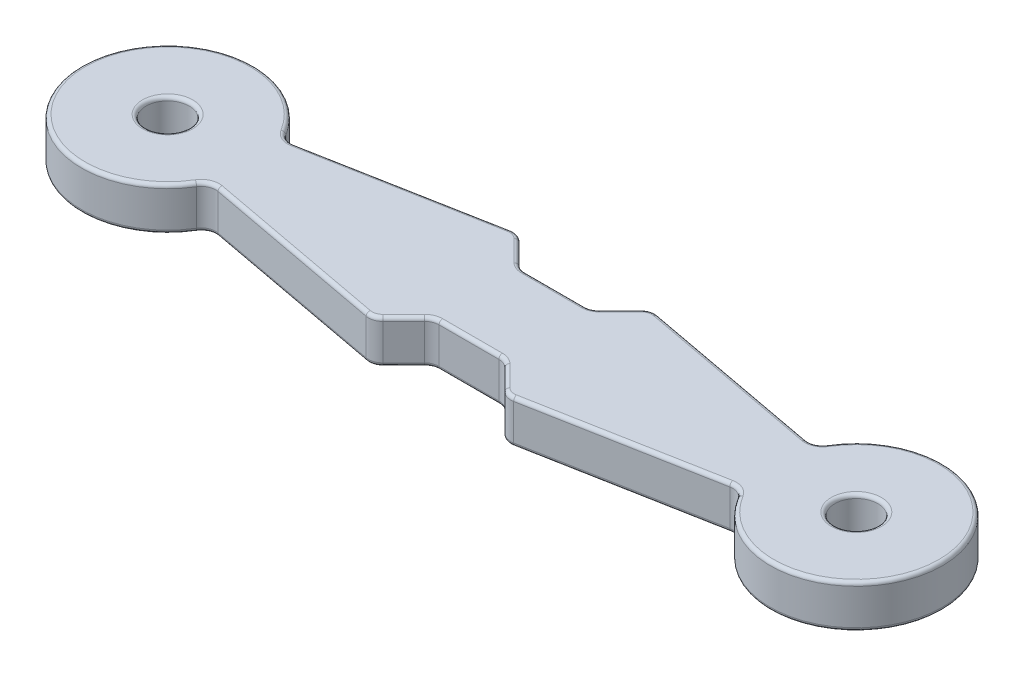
ISO-10303-21;
HEADER;
FILE_DESCRIPTION(('STEP AP214'),'2;1');
FILE_NAME('part.step','',(''),(''),'','','');
FILE_SCHEMA(('AUTOMOTIVE_DESIGN { 1 0 10303 214 1 1 1 1 }'));
ENDSEC;
DATA;
#1=APPLICATION_CONTEXT('core data for automotive mechanical design processes');
#2=APPLICATION_PROTOCOL_DEFINITION('international standard','automotive_design',2000,#1);
#3=PRODUCT_CONTEXT('',#1,'mechanical');
#4=PRODUCT('Part','Part','',(#3));
#5=PRODUCT_RELATED_PRODUCT_CATEGORY('part','',(#4));
#6=PRODUCT_DEFINITION_FORMATION('','',#4);
#7=PRODUCT_DEFINITION_CONTEXT('part definition',#1,'design');
#8=PRODUCT_DEFINITION('design','',#6,#7);
#9=PRODUCT_DEFINITION_SHAPE('','',#8);
#10=(LENGTH_UNIT() NAMED_UNIT(*) SI_UNIT(.MILLI.,.METRE.));
#11=(NAMED_UNIT(*) PLANE_ANGLE_UNIT() SI_UNIT($,.RADIAN.));
#12=(NAMED_UNIT(*) SI_UNIT($,.STERADIAN.) SOLID_ANGLE_UNIT());
#13=UNCERTAINTY_MEASURE_WITH_UNIT(LENGTH_MEASURE(1.E-05),#10,'distance_accuracy_value','');
#14=(GEOMETRIC_REPRESENTATION_CONTEXT(3) GLOBAL_UNCERTAINTY_ASSIGNED_CONTEXT((#13)) GLOBAL_UNIT_ASSIGNED_CONTEXT((#10,
#11,#12)) REPRESENTATION_CONTEXT('',''));
#15=CARTESIAN_POINT('',(0.,0.,0.));
#16=DIRECTION('',(0.,0.,1.));
#17=DIRECTION('',(1.,0.,0.));
#18=AXIS2_PLACEMENT_3D('',#15,#16,#17);
#19=CARTESIAN_POINT('',(48.,3.,0.));
#20=DIRECTION('',(0.,1.,0.));
#21=DIRECTION('',(0.,0.,1.));
#22=AXIS2_PLACEMENT_3D('',#19,#20,#21);
#23=PLANE('',#22);
#24=CARTESIAN_POINT('',(48.,3.,0.));
#25=DIRECTION('',(0.,1.,0.));
#26=DIRECTION('',(0.,0.,1.));
#27=AXIS2_PLACEMENT_3D('',#24,#25,#26);
#28=CIRCLE('',#27,1.75);
#29=CARTESIAN_POINT('',(48.,3.,1.75));
#30=VERTEX_POINT('',#29);
#31=EDGE_CURVE('E521',#30,#30,#28,.F.);
#32=ORIENTED_EDGE('',*,*,#31,.T.);
#33=EDGE_LOOP('',(#32));
#34=FACE_BOUND('',#33,.T.);
#35=CARTESIAN_POINT('',(0.,3.,0.));
#36=DIRECTION('',(0.,1.,0.));
#37=DIRECTION('',(0.,0.,1.));
#38=AXIS2_PLACEMENT_3D('',#35,#36,#37);
#39=CIRCLE('',#38,1.75);
#40=CARTESIAN_POINT('',(0.,3.,1.75));
#41=VERTEX_POINT('',#40);
#42=EDGE_CURVE('E518',#41,#41,#39,.F.);
#43=ORIENTED_EDGE('',*,*,#42,.T.);
#44=EDGE_LOOP('',(#43));
#45=FACE_BOUND('',#44,.T.);
#46=CARTESIAN_POINT('',(42.0181921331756,3.,-3.63565326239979));
#47=DIRECTION('',(0.,1.,0.));
#48=DIRECTION('',(0.,0.,1.));
#49=AXIS2_PLACEMENT_3D('',#46,#47,#48);
#50=CIRCLE('',#49,1.25);
#51=CARTESIAN_POINT('',(43.0863721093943,3.,-2.98642946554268));
#52=VERTEX_POINT('',#51);
#53=CARTESIAN_POINT('',(41.7886238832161,3.,-2.40691471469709));
#54=VERTEX_POINT('',#53);
#55=EDGE_CURVE('E58',#52,#54,#50,.F.);
#56=ORIENTED_EDGE('',*,*,#55,.T.);
#57=DIRECTION('',(-0.982990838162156,0.,-0.183654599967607));
#58=VECTOR('',#57,1.);
#59=CARTESIAN_POINT('',(29.0934893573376,3.,-4.77877797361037));
#60=LINE('',#59,#58);
#61=CARTESIAN_POINT('',(29.0934893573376,3.,-4.77877797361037));
#62=VERTEX_POINT('',#61);
#63=EDGE_CURVE('E53',#54,#62,#60,.T.);
#64=ORIENTED_EDGE('',*,*,#63,.T.);
#65=CARTESIAN_POINT('',(28.9557484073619,3.,-4.04153484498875));
#66=DIRECTION('',(0.,1.,0.));
#67=DIRECTION('',(0.,0.,1.));
#68=AXIS2_PLACEMENT_3D('',#65,#66,#67);
#69=CIRCLE('',#68,0.75);
#70=CARTESIAN_POINT('',(28.4254183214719,3.,-4.57186493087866));
#71=VERTEX_POINT('',#70);
#72=EDGE_CURVE('E515',#62,#71,#69,.T.);
#73=ORIENTED_EDGE('',*,*,#72,.T.);
#74=DIRECTION('',(-0.707106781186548,0.,0.707106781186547));
#75=VECTOR('',#74,1.);
#76=CARTESIAN_POINT('',(26.9696699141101,3.,-3.11611652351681));
#77=LINE('',#76,#75);
#78=CARTESIAN_POINT('',(26.9696699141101,3.,-3.11611652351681));
#79=VERTEX_POINT('',#78);
#80=EDGE_CURVE('E512',#71,#79,#77,.T.);
#81=ORIENTED_EDGE('',*,*,#80,.T.);
#82=CARTESIAN_POINT('',(26.0857864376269,3.,-4.));
#83=DIRECTION('',(0.,1.,0.));
#84=DIRECTION('',(0.,0.,1.));
#85=AXIS2_PLACEMENT_3D('',#82,#83,#84);
#86=CIRCLE('',#85,1.25);
#87=CARTESIAN_POINT('',(26.0857864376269,3.,-2.75));
#88=VERTEX_POINT('',#87);
#89=EDGE_CURVE('E508',#79,#88,#86,.F.);
#90=ORIENTED_EDGE('',*,*,#89,.T.);
#91=DIRECTION('',(-1.,0.,0.));
#92=VECTOR('',#91,1.);
#93=CARTESIAN_POINT('',(21.9142135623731,3.,-2.75));
#94=LINE('',#93,#92);
#95=CARTESIAN_POINT('',(21.9142135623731,3.,-2.75));
#96=VERTEX_POINT('',#95);
#97=EDGE_CURVE('E504',#88,#96,#94,.T.);
#98=ORIENTED_EDGE('',*,*,#97,.T.);
#99=CARTESIAN_POINT('',(21.9142135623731,3.,-4.));
#100=DIRECTION('',(0.,1.,0.));
#101=DIRECTION('',(0.,0.,1.));
#102=AXIS2_PLACEMENT_3D('',#99,#100,#101);
#103=CIRCLE('',#102,1.25);
#104=CARTESIAN_POINT('',(21.0303300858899,3.,-3.11611652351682));
#105=VERTEX_POINT('',#104);
#106=EDGE_CURVE('E500',#96,#105,#103,.F.);
#107=ORIENTED_EDGE('',*,*,#106,.T.);
#108=DIRECTION('',(-0.707106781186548,0.,-0.707106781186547));
#109=VECTOR('',#108,1.);
#110=CARTESIAN_POINT('',(19.5745816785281,3.,-4.57186493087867));
#111=LINE('',#110,#109);
#112=CARTESIAN_POINT('',(19.5745816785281,3.,-4.57186493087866));
#113=VERTEX_POINT('',#112);
#114=EDGE_CURVE('E496',#105,#113,#111,.T.);
#115=ORIENTED_EDGE('',*,*,#114,.T.);
#116=CARTESIAN_POINT('',(19.0442515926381,3.,-4.04153484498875));
#117=DIRECTION('',(0.,1.,0.));
#118=DIRECTION('',(0.,0.,1.));
#119=AXIS2_PLACEMENT_3D('',#116,#117,#118);
#120=CIRCLE('',#119,0.75);
#121=CARTESIAN_POINT('',(18.9065106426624,3.,-4.77877797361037));
#122=VERTEX_POINT('',#121);
#123=EDGE_CURVE('E492',#113,#122,#120,.T.);
#124=ORIENTED_EDGE('',*,*,#123,.T.);
#125=DIRECTION('',(-0.982990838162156,0.,0.183654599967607));
#126=VECTOR('',#125,1.);
#127=CARTESIAN_POINT('',(6.21137611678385,3.,-2.40691471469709));
#128=LINE('',#127,#126);
#129=CARTESIAN_POINT('',(6.21137611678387,3.,-2.40691471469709));
#130=VERTEX_POINT('',#129);
#131=EDGE_CURVE('E488',#122,#130,#128,.T.);
#132=ORIENTED_EDGE('',*,*,#131,.T.);
#133=CARTESIAN_POINT('',(5.98180786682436,3.,-3.63565326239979));
#134=DIRECTION('',(0.,1.,0.));
#135=DIRECTION('',(0.,0.,1.));
#136=AXIS2_PLACEMENT_3D('',#133,#134,#135);
#137=CIRCLE('',#136,1.25);
#138=CARTESIAN_POINT('',(4.91362789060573,3.,-2.98642946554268));
#139=VERTEX_POINT('',#138);
#140=EDGE_CURVE('E484',#130,#139,#137,.F.);
#141=ORIENTED_EDGE('',*,*,#140,.T.);
#142=CARTESIAN_POINT('',(0.,3.,0.));
#143=DIRECTION('',(0.,1.,0.));
#144=DIRECTION('',(0.,0.,1.));
#145=AXIS2_PLACEMENT_3D('',#142,#143,#144);
#146=CIRCLE('',#145,5.75);
#147=CARTESIAN_POINT('',(4.91362789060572,3.,2.98642946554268));
#148=VERTEX_POINT('',#147);
#149=EDGE_CURVE('E480',#139,#148,#146,.T.);
#150=ORIENTED_EDGE('',*,*,#149,.T.);
#151=CARTESIAN_POINT('',(5.98180786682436,3.,3.63565326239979));
#152=DIRECTION('',(0.,1.,0.));
#153=DIRECTION('',(0.,0.,1.));
#154=AXIS2_PLACEMENT_3D('',#151,#152,#153);
#155=CIRCLE('',#154,1.25);
#156=CARTESIAN_POINT('',(6.21137611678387,3.,2.4069147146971));
#157=VERTEX_POINT('',#156);
#158=EDGE_CURVE('E475',#148,#157,#155,.F.);
#159=ORIENTED_EDGE('',*,*,#158,.T.);
#160=DIRECTION('',(0.982990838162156,0.,0.183654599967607));
#161=VECTOR('',#160,1.);
#162=CARTESIAN_POINT('',(18.9065106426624,3.,4.77877797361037));
#163=LINE('',#162,#161);
#164=CARTESIAN_POINT('',(18.9065106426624,3.,4.77877797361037));
#165=VERTEX_POINT('',#164);
#166=EDGE_CURVE('E471',#157,#165,#163,.T.);
#167=ORIENTED_EDGE('',*,*,#166,.T.);
#168=CARTESIAN_POINT('',(19.0442515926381,3.,4.04153484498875));
#169=DIRECTION('',(0.,1.,0.));
#170=DIRECTION('',(0.,0.,1.));
#171=AXIS2_PLACEMENT_3D('',#168,#169,#170);
#172=CIRCLE('',#171,0.75);
#173=CARTESIAN_POINT('',(19.5745816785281,3.,4.57186493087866));
#174=VERTEX_POINT('',#173);
#175=EDGE_CURVE('E473',#165,#174,#172,.T.);
#176=ORIENTED_EDGE('',*,*,#175,.T.);
#177=DIRECTION('',(0.707106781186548,0.,-0.707106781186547));
#178=VECTOR('',#177,1.);
#179=CARTESIAN_POINT('',(21.0303300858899,3.,3.11611652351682));
#180=LINE('',#179,#178);
#181=CARTESIAN_POINT('',(21.0303300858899,3.,3.11611652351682));
#182=VERTEX_POINT('',#181);
#183=EDGE_CURVE('E478',#174,#182,#180,.T.);
#184=ORIENTED_EDGE('',*,*,#183,.T.);
#185=CARTESIAN_POINT('',(21.9142135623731,3.,4.));
#186=DIRECTION('',(0.,1.,0.));
#187=DIRECTION('',(0.,0.,1.));
#188=AXIS2_PLACEMENT_3D('',#185,#186,#187);
#189=CIRCLE('',#188,1.25);
#190=CARTESIAN_POINT('',(21.9142135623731,3.,2.75));
#191=VERTEX_POINT('',#190);
#192=EDGE_CURVE('E482',#182,#191,#189,.F.);
#193=ORIENTED_EDGE('',*,*,#192,.T.);
#194=DIRECTION('',(1.,0.,0.));
#195=VECTOR('',#194,1.);
#196=CARTESIAN_POINT('',(26.0857864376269,3.,2.75));
#197=LINE('',#196,#195);
#198=CARTESIAN_POINT('',(26.0857864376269,3.,2.75));
#199=VERTEX_POINT('',#198);
#200=EDGE_CURVE('E486',#191,#199,#197,.T.);
#201=ORIENTED_EDGE('',*,*,#200,.T.);
#202=CARTESIAN_POINT('',(26.0857864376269,3.,4.));
#203=DIRECTION('',(0.,1.,0.));
#204=DIRECTION('',(0.,0.,1.));
#205=AXIS2_PLACEMENT_3D('',#202,#203,#204);
#206=CIRCLE('',#205,1.25);
#207=CARTESIAN_POINT('',(26.9696699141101,3.,3.11611652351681));
#208=VERTEX_POINT('',#207);
#209=EDGE_CURVE('E490',#199,#208,#206,.F.);
#210=ORIENTED_EDGE('',*,*,#209,.T.);
#211=DIRECTION('',(0.707106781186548,0.,0.707106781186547));
#212=VECTOR('',#211,1.);
#213=CARTESIAN_POINT('',(28.4254183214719,3.,4.57186493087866));
#214=LINE('',#213,#212);
#215=CARTESIAN_POINT('',(28.4254183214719,3.,4.57186493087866));
#216=VERTEX_POINT('',#215);
#217=EDGE_CURVE('E494',#208,#216,#214,.T.);
#218=ORIENTED_EDGE('',*,*,#217,.T.);
#219=CARTESIAN_POINT('',(28.9557484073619,3.,4.04153484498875));
#220=DIRECTION('',(0.,1.,0.));
#221=DIRECTION('',(0.,0.,1.));
#222=AXIS2_PLACEMENT_3D('',#219,#220,#221);
#223=CIRCLE('',#222,0.75);
#224=CARTESIAN_POINT('',(29.0934893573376,3.,4.77877797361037));
#225=VERTEX_POINT('',#224);
#226=EDGE_CURVE('E498',#216,#225,#223,.T.);
#227=ORIENTED_EDGE('',*,*,#226,.T.);
#228=DIRECTION('',(0.982990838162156,0.,-0.183654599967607));
#229=VECTOR('',#228,1.);
#230=CARTESIAN_POINT('',(41.7886238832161,3.,2.40691471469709));
#231=LINE('',#230,#229);
#232=CARTESIAN_POINT('',(41.7886238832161,3.,2.40691471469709));
#233=VERTEX_POINT('',#232);
#234=EDGE_CURVE('E502',#225,#233,#231,.T.);
#235=ORIENTED_EDGE('',*,*,#234,.T.);
#236=CARTESIAN_POINT('',(42.0181921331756,3.,3.63565326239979));
#237=DIRECTION('',(0.,1.,0.));
#238=DIRECTION('',(0.,0.,1.));
#239=AXIS2_PLACEMENT_3D('',#236,#237,#238);
#240=CIRCLE('',#239,1.25);
#241=CARTESIAN_POINT('',(43.0863721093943,3.,2.98642946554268));
#242=VERTEX_POINT('',#241);
#243=EDGE_CURVE('E506',#233,#242,#240,.F.);
#244=ORIENTED_EDGE('',*,*,#243,.T.);
#245=CARTESIAN_POINT('',(48.,3.,0.));
#246=DIRECTION('',(0.,1.,0.));
#247=DIRECTION('',(0.,0.,1.));
#248=AXIS2_PLACEMENT_3D('',#245,#246,#247);
#249=CIRCLE('',#248,5.75);
#250=EDGE_CURVE('E510',#242,#52,#249,.T.);
#251=ORIENTED_EDGE('',*,*,#250,.T.);
#252=EDGE_LOOP('',(#56,#64,#73,#81,#90,#98,#107,#115,#124,#132,#141,#150,#159,#167,#176,#184,
#193,#201,#210,#218,#227,#235,#244,#251));
#253=FACE_BOUND('',#252,.T.);
#254=ADVANCED_FACE('F36',(#34,#45,#253),#23,.T.);
#255=CARTESIAN_POINT('',(48.,0.,0.));
#256=DIRECTION('',(0.,1.,0.));
#257=DIRECTION('',(0.,0.,1.));
#258=AXIS2_PLACEMENT_3D('',#255,#256,#257);
#259=PLANE('',#258);
#260=CARTESIAN_POINT('',(48.,0.,0.));
#261=DIRECTION('',(0.,1.,0.));
#262=DIRECTION('',(0.,0.,1.));
#263=AXIS2_PLACEMENT_3D('',#260,#261,#262);
#264=CIRCLE('',#263,1.75);
#265=CARTESIAN_POINT('',(48.,0.,1.75));
#266=VERTEX_POINT('',#265);
#267=EDGE_CURVE('E419',#266,#266,#264,.T.);
#268=ORIENTED_EDGE('',*,*,#267,.T.);
#269=EDGE_LOOP('',(#268));
#270=FACE_BOUND('',#269,.T.);
#271=CARTESIAN_POINT('',(0.,0.,0.));
#272=DIRECTION('',(0.,1.,0.));
#273=DIRECTION('',(0.,0.,1.));
#274=AXIS2_PLACEMENT_3D('',#271,#272,#273);
#275=CIRCLE('',#274,1.75);
#276=CARTESIAN_POINT('',(0.,0.,1.75));
#277=VERTEX_POINT('',#276);
#278=EDGE_CURVE('E416',#277,#277,#275,.T.);
#279=ORIENTED_EDGE('',*,*,#278,.T.);
#280=EDGE_LOOP('',(#279));
#281=FACE_BOUND('',#280,.T.);
#282=CARTESIAN_POINT('',(19.0442515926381,0.,4.04153484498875));
#283=DIRECTION('',(0.,1.,0.));
#284=DIRECTION('',(0.,0.,1.));
#285=AXIS2_PLACEMENT_3D('',#282,#283,#284);
#286=CIRCLE('',#285,0.75);
#287=CARTESIAN_POINT('',(19.5745816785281,0.,4.57186493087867));
#288=VERTEX_POINT('',#287);
#289=CARTESIAN_POINT('',(18.9065106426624,0.,4.77877797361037));
#290=VERTEX_POINT('',#289);
#291=EDGE_CURVE('E412',#288,#290,#286,.F.);
#292=ORIENTED_EDGE('',*,*,#291,.T.);
#293=DIRECTION('',(0.982990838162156,0.,0.183654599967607));
#294=VECTOR('',#293,1.);
#295=CARTESIAN_POINT('',(46.1559887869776,0.,9.86986510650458));
#296=LINE('',#295,#294);
#297=CARTESIAN_POINT('',(6.21137611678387,0.,2.40691471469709));
#298=VERTEX_POINT('',#297);
#299=EDGE_CURVE('E414',#290,#298,#296,.F.);
#300=ORIENTED_EDGE('',*,*,#299,.T.);
#301=CARTESIAN_POINT('',(5.98180786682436,0.,3.63565326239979));
#302=DIRECTION('',(0.,1.,0.));
#303=DIRECTION('',(0.,0.,1.));
#304=AXIS2_PLACEMENT_3D('',#301,#302,#303);
#305=CIRCLE('',#304,1.25);
#306=CARTESIAN_POINT('',(4.91362789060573,0.,2.98642946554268));
#307=VERTEX_POINT('',#306);
#308=EDGE_CURVE('E410',#298,#307,#305,.T.);
#309=ORIENTED_EDGE('',*,*,#308,.T.);
#310=CARTESIAN_POINT('',(0.,0.,0.));
#311=DIRECTION('',(0.,1.,0.));
#312=DIRECTION('',(0.,0.,1.));
#313=AXIS2_PLACEMENT_3D('',#310,#311,#312);
#314=CIRCLE('',#313,5.75);
#315=CARTESIAN_POINT('',(4.91362789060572,0.,-2.98642946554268));
#316=VERTEX_POINT('',#315);
#317=EDGE_CURVE('E408',#307,#316,#314,.F.);
#318=ORIENTED_EDGE('',*,*,#317,.T.);
#319=CARTESIAN_POINT('',(5.98180786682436,0.,-3.63565326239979));
#320=DIRECTION('',(0.,1.,0.));
#321=DIRECTION('',(0.,0.,1.));
#322=AXIS2_PLACEMENT_3D('',#319,#320,#321);
#323=CIRCLE('',#322,1.25);
#324=CARTESIAN_POINT('',(6.21137611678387,0.,-2.40691471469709));
#325=VERTEX_POINT('',#324);
#326=EDGE_CURVE('E402',#316,#325,#323,.T.);
#327=ORIENTED_EDGE('',*,*,#326,.T.);
#328=DIRECTION('',(-0.982990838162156,0.,0.183654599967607));
#329=VECTOR('',#328,1.);
#330=CARTESIAN_POINT('',(46.1559887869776,0.,-9.86986510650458));
#331=LINE('',#330,#329);
#332=CARTESIAN_POINT('',(18.9065106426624,0.,-4.77877797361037));
#333=VERTEX_POINT('',#332);
#334=EDGE_CURVE('E400',#325,#333,#331,.F.);
#335=ORIENTED_EDGE('',*,*,#334,.T.);
#336=CARTESIAN_POINT('',(19.0442515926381,0.,-4.04153484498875));
#337=DIRECTION('',(0.,1.,0.));
#338=DIRECTION('',(0.,0.,1.));
#339=AXIS2_PLACEMENT_3D('',#336,#337,#338);
#340=CIRCLE('',#339,0.75);
#341=CARTESIAN_POINT('',(19.5745816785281,0.,-4.57186493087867));
#342=VERTEX_POINT('',#341);
#343=EDGE_CURVE('E394',#333,#342,#340,.F.);
#344=ORIENTED_EDGE('',*,*,#343,.T.);
#345=DIRECTION('',(-0.707106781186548,0.,-0.707106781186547));
#346=VECTOR('',#345,1.);
#347=CARTESIAN_POINT('',(36.0732233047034,0.,11.9267766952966));
#348=LINE('',#347,#346);
#349=CARTESIAN_POINT('',(21.0303300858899,0.,-3.11611652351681));
#350=VERTEX_POINT('',#349);
#351=EDGE_CURVE('E392',#342,#350,#348,.F.);
#352=ORIENTED_EDGE('',*,*,#351,.T.);
#353=CARTESIAN_POINT('',(21.9142135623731,0.,-4.));
#354=DIRECTION('',(0.,1.,0.));
#355=DIRECTION('',(0.,0.,1.));
#356=AXIS2_PLACEMENT_3D('',#353,#354,#355);
#357=CIRCLE('',#356,1.25);
#358=CARTESIAN_POINT('',(21.9142135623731,0.,-2.75));
#359=VERTEX_POINT('',#358);
#360=EDGE_CURVE('E386',#350,#359,#357,.T.);
#361=ORIENTED_EDGE('',*,*,#360,.T.);
#362=DIRECTION('',(-1.,0.,0.));
#363=VECTOR('',#362,1.);
#364=CARTESIAN_POINT('',(48.,0.,-2.75));
#365=LINE('',#364,#363);
#366=CARTESIAN_POINT('',(26.0857864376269,0.,-2.75));
#367=VERTEX_POINT('',#366);
#368=EDGE_CURVE('E384',#359,#367,#365,.F.);
#369=ORIENTED_EDGE('',*,*,#368,.T.);
#370=CARTESIAN_POINT('',(26.0857864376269,0.,-4.));
#371=DIRECTION('',(0.,1.,0.));
#372=DIRECTION('',(0.,0.,1.));
#373=AXIS2_PLACEMENT_3D('',#370,#371,#372);
#374=CIRCLE('',#373,1.25);
#375=CARTESIAN_POINT('',(26.9696699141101,0.,-3.11611652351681));
#376=VERTEX_POINT('',#375);
#377=EDGE_CURVE('E378',#367,#376,#374,.T.);
#378=ORIENTED_EDGE('',*,*,#377,.T.);
#379=DIRECTION('',(-0.707106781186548,0.,0.707106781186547));
#380=VECTOR('',#379,1.);
#381=CARTESIAN_POINT('',(35.9267766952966,0.,-12.0732233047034));
#382=LINE('',#381,#380);
#383=CARTESIAN_POINT('',(28.4254183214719,0.,-4.57186493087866));
#384=VERTEX_POINT('',#383);
#385=EDGE_CURVE('E348',#376,#384,#382,.F.);
#386=ORIENTED_EDGE('',*,*,#385,.T.);
#387=CARTESIAN_POINT('',(28.9557484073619,0.,-4.04153484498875));
#388=DIRECTION('',(0.,1.,0.));
#389=DIRECTION('',(0.,0.,1.));
#390=AXIS2_PLACEMENT_3D('',#387,#388,#389);
#391=CIRCLE('',#390,0.75);
#392=CARTESIAN_POINT('',(29.0934893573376,0.,-4.77877797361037));
#393=VERTEX_POINT('',#392);
#394=EDGE_CURVE('E340',#384,#393,#391,.F.);
#395=ORIENTED_EDGE('',*,*,#394,.T.);
#396=DIRECTION('',(-0.982990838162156,0.,-0.183654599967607));
#397=VECTOR('',#396,1.);
#398=CARTESIAN_POINT('',(48.2250186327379,0.,-1.20438722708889));
#399=LINE('',#398,#397);
#400=CARTESIAN_POINT('',(41.7886238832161,0.,-2.40691471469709));
#401=VERTEX_POINT('',#400);
#402=EDGE_CURVE('E345',#393,#401,#399,.F.);
#403=ORIENTED_EDGE('',*,*,#402,.T.);
#404=CARTESIAN_POINT('',(42.0181921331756,0.,-3.63565326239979));
#405=DIRECTION('',(0.,1.,0.));
#406=DIRECTION('',(0.,0.,1.));
#407=AXIS2_PLACEMENT_3D('',#404,#405,#406);
#408=CIRCLE('',#407,1.25);
#409=CARTESIAN_POINT('',(43.0863721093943,0.,-2.98642946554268));
#410=VERTEX_POINT('',#409);
#411=EDGE_CURVE('E352',#401,#410,#408,.T.);
#412=ORIENTED_EDGE('',*,*,#411,.T.);
#413=CARTESIAN_POINT('',(48.,0.,0.));
#414=DIRECTION('',(0.,1.,0.));
#415=DIRECTION('',(0.,0.,1.));
#416=AXIS2_PLACEMENT_3D('',#413,#414,#415);
#417=CIRCLE('',#416,5.75);
#418=CARTESIAN_POINT('',(43.0863721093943,0.,2.98642946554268));
#419=VERTEX_POINT('',#418);
#420=EDGE_CURVE('E375',#410,#419,#417,.F.);
#421=ORIENTED_EDGE('',*,*,#420,.T.);
#422=CARTESIAN_POINT('',(42.0181921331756,0.,3.63565326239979));
#423=DIRECTION('',(0.,1.,0.));
#424=DIRECTION('',(0.,0.,1.));
#425=AXIS2_PLACEMENT_3D('',#422,#423,#424);
#426=CIRCLE('',#425,1.25);
#427=CARTESIAN_POINT('',(41.7886238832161,0.,2.40691471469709));
#428=VERTEX_POINT('',#427);
#429=EDGE_CURVE('E380',#419,#428,#426,.T.);
#430=ORIENTED_EDGE('',*,*,#429,.T.);
#431=DIRECTION('',(0.982990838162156,0.,-0.183654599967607));
#432=VECTOR('',#431,1.);
#433=CARTESIAN_POINT('',(48.2250186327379,0.,1.20438722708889));
#434=LINE('',#433,#432);
#435=CARTESIAN_POINT('',(29.0934893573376,0.,4.77877797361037));
#436=VERTEX_POINT('',#435);
#437=EDGE_CURVE('E382',#428,#436,#434,.F.);
#438=ORIENTED_EDGE('',*,*,#437,.T.);
#439=CARTESIAN_POINT('',(28.9557484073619,0.,4.04153484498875));
#440=DIRECTION('',(0.,1.,0.));
#441=DIRECTION('',(0.,0.,1.));
#442=AXIS2_PLACEMENT_3D('',#439,#440,#441);
#443=CIRCLE('',#442,0.75);
#444=CARTESIAN_POINT('',(28.4254183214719,0.,4.57186493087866));
#445=VERTEX_POINT('',#444);
#446=EDGE_CURVE('E388',#436,#445,#443,.F.);
#447=ORIENTED_EDGE('',*,*,#446,.T.);
#448=DIRECTION('',(0.707106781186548,0.,0.707106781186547));
#449=VECTOR('',#448,1.);
#450=CARTESIAN_POINT('',(35.9267766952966,0.,12.0732233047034));
#451=LINE('',#450,#449);
#452=CARTESIAN_POINT('',(26.9696699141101,0.,3.11611652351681));
#453=VERTEX_POINT('',#452);
#454=EDGE_CURVE('E390',#445,#453,#451,.F.);
#455=ORIENTED_EDGE('',*,*,#454,.T.);
#456=CARTESIAN_POINT('',(26.0857864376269,0.,4.));
#457=DIRECTION('',(0.,1.,0.));
#458=DIRECTION('',(0.,0.,1.));
#459=AXIS2_PLACEMENT_3D('',#456,#457,#458);
#460=CIRCLE('',#459,1.25);
#461=CARTESIAN_POINT('',(26.0857864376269,0.,2.75));
#462=VERTEX_POINT('',#461);
#463=EDGE_CURVE('E396',#453,#462,#460,.T.);
#464=ORIENTED_EDGE('',*,*,#463,.T.);
#465=DIRECTION('',(1.,0.,0.));
#466=VECTOR('',#465,1.);
#467=CARTESIAN_POINT('',(48.,0.,2.75));
#468=LINE('',#467,#466);
#469=CARTESIAN_POINT('',(21.9142135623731,0.,2.75));
#470=VERTEX_POINT('',#469);
#471=EDGE_CURVE('E398',#462,#470,#468,.F.);
#472=ORIENTED_EDGE('',*,*,#471,.T.);
#473=CARTESIAN_POINT('',(21.9142135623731,0.,4.));
#474=DIRECTION('',(0.,1.,0.));
#475=DIRECTION('',(0.,0.,1.));
#476=AXIS2_PLACEMENT_3D('',#473,#474,#475);
#477=CIRCLE('',#476,1.25);
#478=CARTESIAN_POINT('',(21.0303300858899,0.,3.11611652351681));
#479=VERTEX_POINT('',#478);
#480=EDGE_CURVE('E404',#470,#479,#477,.T.);
#481=ORIENTED_EDGE('',*,*,#480,.T.);
#482=DIRECTION('',(0.707106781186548,0.,-0.707106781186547));
#483=VECTOR('',#482,1.);
#484=CARTESIAN_POINT('',(36.0732233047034,0.,-11.9267766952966));
#485=LINE('',#484,#483);
#486=EDGE_CURVE('E406',#479,#288,#485,.F.);
#487=ORIENTED_EDGE('',*,*,#486,.T.);
#488=EDGE_LOOP('',(#292,#300,#309,#318,#327,#335,#344,#352,#361,#369,#378,#386,#395,#403,#412,
#421,#430,#438,#447,#455,#464,#472,#481,#487));
#489=FACE_BOUND('',#488,.T.);
#490=ADVANCED_FACE('F342',(#270,#281,#489),#259,.F.);
#491=CARTESIAN_POINT('',(26.5,3.,-3.));
#492=DIRECTION('',(0.707106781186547,0.,0.707106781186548));
#493=DIRECTION('',(0.707106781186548,0.,-0.707106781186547));
#494=AXIS2_PLACEMENT_3D('',#491,#492,#493);
#495=PLANE('',#494);
#496=DIRECTION('',(0.,-1.,0.));
#497=VECTOR('',#496,1.);
#498=CARTESIAN_POINT('',(28.2486416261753,3.,-4.7486416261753));
#499=LINE('',#498,#497);
#500=CARTESIAN_POINT('',(28.2486416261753,2.75,-4.7486416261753));
#501=VERTEX_POINT('',#500);
#502=CARTESIAN_POINT('',(28.2486416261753,0.25,-4.7486416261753));
#503=VERTEX_POINT('',#502);
#504=EDGE_CURVE('E925',#501,#503,#499,.T.);
#505=ORIENTED_EDGE('',*,*,#504,.T.);
#506=DIRECTION('',(-0.707106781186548,0.,0.707106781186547));
#507=VECTOR('',#506,1.);
#508=CARTESIAN_POINT('',(26.5,0.25,-3.));
#509=LINE('',#508,#507);
#510=CARTESIAN_POINT('',(26.7928932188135,0.25,-3.29289321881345));
#511=VERTEX_POINT('',#510);
#512=EDGE_CURVE('E538',#503,#511,#509,.T.);
#513=ORIENTED_EDGE('',*,*,#512,.T.);
#514=DIRECTION('',(0.,-1.,0.));
#515=VECTOR('',#514,1.);
#516=CARTESIAN_POINT('',(26.7928932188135,3.,-3.29289321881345));
#517=LINE('',#516,#515);
#518=CARTESIAN_POINT('',(26.7928932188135,2.75,-3.29289321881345));
#519=VERTEX_POINT('',#518);
#520=EDGE_CURVE('E644',#511,#519,#517,.F.);
#521=ORIENTED_EDGE('',*,*,#520,.T.);
#522=DIRECTION('',(-0.707106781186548,0.,0.707106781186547));
#523=VECTOR('',#522,1.);
#524=CARTESIAN_POINT('',(28.2486416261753,2.75,-4.7486416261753));
#525=LINE('',#524,#523);
#526=EDGE_CURVE('E536',#519,#501,#525,.F.);
#527=ORIENTED_EDGE('',*,*,#526,.T.);
#528=EDGE_LOOP('',(#505,#513,#521,#527));
#529=FACE_BOUND('',#528,.T.);
#530=ADVANCED_FACE('F922',(#529),#495,.F.);
#531=CARTESIAN_POINT('',(26.5,3.,-3.));
#532=DIRECTION('',(0.,0.,1.));
#533=DIRECTION('',(1.,0.,0.));
#534=AXIS2_PLACEMENT_3D('',#531,#532,#533);
#535=PLANE('',#534);
#536=DIRECTION('',(0.,-1.,0.));
#537=VECTOR('',#536,1.);
#538=CARTESIAN_POINT('',(26.0857864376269,0.,-3.));
#539=LINE('',#538,#537);
#540=CARTESIAN_POINT('',(26.0857864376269,2.75,-3.));
#541=VERTEX_POINT('',#540);
#542=CARTESIAN_POINT('',(26.0857864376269,0.25,-3.));
#543=VERTEX_POINT('',#542);
#544=EDGE_CURVE('E370',#541,#543,#539,.T.);
#545=ORIENTED_EDGE('',*,*,#544,.T.);
#546=DIRECTION('',(-1.,0.,0.));
#547=VECTOR('',#546,1.);
#548=CARTESIAN_POINT('',(26.5,0.25,-3.));
#549=LINE('',#548,#547);
#550=CARTESIAN_POINT('',(21.9142135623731,0.25,-3.));
#551=VERTEX_POINT('',#550);
#552=EDGE_CURVE('E542',#543,#551,#549,.T.);
#553=ORIENTED_EDGE('',*,*,#552,.T.);
#554=DIRECTION('',(0.,-1.,0.));
#555=VECTOR('',#554,1.);
#556=CARTESIAN_POINT('',(21.9142135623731,3.,-3.));
#557=LINE('',#556,#555);
#558=CARTESIAN_POINT('',(21.9142135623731,2.75,-3.));
#559=VERTEX_POINT('',#558);
#560=EDGE_CURVE('E367',#551,#559,#557,.F.);
#561=ORIENTED_EDGE('',*,*,#560,.T.);
#562=DIRECTION('',(-1.,0.,0.));
#563=VECTOR('',#562,1.);
#564=CARTESIAN_POINT('',(26.0857864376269,2.75,-3.));
#565=LINE('',#564,#563);
#566=EDGE_CURVE('E540',#559,#541,#565,.F.);
#567=ORIENTED_EDGE('',*,*,#566,.T.);
#568=EDGE_LOOP('',(#545,#553,#561,#567));
#569=FACE_BOUND('',#568,.T.);
#570=ADVANCED_FACE('F792',(#569),#535,.F.);
#571=CARTESIAN_POINT('',(21.5,3.,-3.));
#572=DIRECTION('',(-0.707106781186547,0.,0.707106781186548));
#573=DIRECTION('',(0.707106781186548,0.,0.707106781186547));
#574=AXIS2_PLACEMENT_3D('',#571,#572,#573);
#575=PLANE('',#574);
#576=DIRECTION('',(0.,-1.,0.));
#577=VECTOR('',#576,1.);
#578=CARTESIAN_POINT('',(21.2071067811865,0.,-3.29289321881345));
#579=LINE('',#578,#577);
#580=CARTESIAN_POINT('',(21.2071067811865,2.75,-3.29289321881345));
#581=VERTEX_POINT('',#580);
#582=CARTESIAN_POINT('',(21.2071067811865,0.25,-3.29289321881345));
#583=VERTEX_POINT('',#582);
#584=EDGE_CURVE('E783',#581,#583,#579,.T.);
#585=ORIENTED_EDGE('',*,*,#584,.T.);
#586=DIRECTION('',(-0.707106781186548,0.,-0.707106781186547));
#587=VECTOR('',#586,1.);
#588=CARTESIAN_POINT('',(21.5,0.25,-3.));
#589=LINE('',#588,#587);
#590=CARTESIAN_POINT('',(19.7513583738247,0.25,-4.7486416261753));
#591=VERTEX_POINT('',#590);
#592=EDGE_CURVE('E546',#583,#591,#589,.T.);
#593=ORIENTED_EDGE('',*,*,#592,.T.);
#594=DIRECTION('',(0.,-1.,0.));
#595=VECTOR('',#594,1.);
#596=CARTESIAN_POINT('',(19.7513583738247,3.,-4.7486416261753));
#597=LINE('',#596,#595);
#598=CARTESIAN_POINT('',(19.7513583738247,2.75,-4.7486416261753));
#599=VERTEX_POINT('',#598);
#600=EDGE_CURVE('E786',#591,#599,#597,.F.);
#601=ORIENTED_EDGE('',*,*,#600,.T.);
#602=DIRECTION('',(-0.707106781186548,0.,-0.707106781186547));
#603=VECTOR('',#602,1.);
#604=CARTESIAN_POINT('',(21.2071067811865,2.75,-3.29289321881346));
#605=LINE('',#604,#603);
#606=EDGE_CURVE('E544',#599,#581,#605,.F.);
#607=ORIENTED_EDGE('',*,*,#606,.T.);
#608=EDGE_LOOP('',(#585,#593,#601,#607));
#609=FACE_BOUND('',#608,.T.);
#610=ADVANCED_FACE('F819',(#609),#575,.F.);
#611=CARTESIAN_POINT('',(19.3786796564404,3.,-5.12132034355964));
#612=DIRECTION('',(0.183654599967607,0.,0.982990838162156));
#613=DIRECTION('',(0.982990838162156,0.,-0.183654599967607));
#614=AXIS2_PLACEMENT_3D('',#611,#612,#613);
#615=PLANE('',#614);
#616=DIRECTION('',(0.,-1.,0.));
#617=VECTOR('',#616,1.);
#618=CARTESIAN_POINT('',(18.8605969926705,3.,-5.02452568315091));
#619=LINE('',#618,#617);
#620=CARTESIAN_POINT('',(18.8605969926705,2.75,-5.02452568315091));
#621=VERTEX_POINT('',#620);
#622=CARTESIAN_POINT('',(18.8605969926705,0.25,-5.02452568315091));
#623=VERTEX_POINT('',#622);
#624=EDGE_CURVE('E777',#621,#623,#619,.T.);
#625=ORIENTED_EDGE('',*,*,#624,.T.);
#626=DIRECTION('',(-0.982990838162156,0.,0.183654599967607));
#627=VECTOR('',#626,1.);
#628=CARTESIAN_POINT('',(19.3786796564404,0.25,-5.12132034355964));
#629=LINE('',#628,#627);
#630=CARTESIAN_POINT('',(6.16546246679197,0.25,-2.65266242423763));
#631=VERTEX_POINT('',#630);
#632=EDGE_CURVE('E550',#623,#631,#629,.T.);
#633=ORIENTED_EDGE('',*,*,#632,.T.);
#634=DIRECTION('',(0.,1.,0.));
#635=VECTOR('',#634,1.);
#636=CARTESIAN_POINT('',(6.16546246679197,3.,-2.65266242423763));
#637=LINE('',#636,#635);
#638=CARTESIAN_POINT('',(6.16546246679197,2.75,-2.65266242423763));
#639=VERTEX_POINT('',#638);
#640=EDGE_CURVE('E780',#631,#639,#637,.T.);
#641=ORIENTED_EDGE('',*,*,#640,.T.);
#642=DIRECTION('',(-0.982990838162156,0.,0.183654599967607));
#643=VECTOR('',#642,1.);
#644=CARTESIAN_POINT('',(18.8605969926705,2.75,-5.02452568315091));
#645=LINE('',#644,#643);
#646=EDGE_CURVE('E548',#639,#621,#645,.F.);
#647=ORIENTED_EDGE('',*,*,#646,.T.);
#648=EDGE_LOOP('',(#625,#633,#641,#647));
#649=FACE_BOUND('',#648,.T.);
#650=ADVANCED_FACE('F836',(#649),#615,.F.);
#651=CARTESIAN_POINT('',(0.,3.,0.));
#652=DIRECTION('',(0.,-1.,0.));
#653=DIRECTION('',(0.,0.,-1.));
#654=AXIS2_PLACEMENT_3D('',#651,#652,#653);
#655=CYLINDRICAL_SURFACE('',#654,6.);
#656=DIRECTION('',(0.,-1.,0.));
#657=VECTOR('',#656,1.);
#658=CARTESIAN_POINT('',(5.12726388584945,3.,-3.1162742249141));
#659=LINE('',#658,#657);
#660=CARTESIAN_POINT('',(5.12726388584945,2.75,-3.1162742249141));
#661=VERTEX_POINT('',#660);
#662=CARTESIAN_POINT('',(5.12726388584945,0.25,-3.1162742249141));
#663=VERTEX_POINT('',#662);
#664=EDGE_CURVE('E771',#661,#663,#659,.T.);
#665=ORIENTED_EDGE('',*,*,#664,.T.);
#666=CARTESIAN_POINT('',(0.,0.25,0.));
#667=DIRECTION('',(0.,1.,0.));
#668=DIRECTION('',(0.,0.,1.));
#669=AXIS2_PLACEMENT_3D('',#666,#667,#668);
#670=CIRCLE('',#669,6.);
#671=CARTESIAN_POINT('',(5.12726388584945,0.25,3.1162742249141));
#672=VERTEX_POINT('',#671);
#673=EDGE_CURVE('E554',#663,#672,#670,.T.);
#674=ORIENTED_EDGE('',*,*,#673,.T.);
#675=DIRECTION('',(0.,-1.,0.));
#676=VECTOR('',#675,1.);
#677=CARTESIAN_POINT('',(5.12726388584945,3.,3.1162742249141));
#678=LINE('',#677,#676);
#679=CARTESIAN_POINT('',(5.12726388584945,2.75,3.1162742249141));
#680=VERTEX_POINT('',#679);
#681=EDGE_CURVE('E774',#672,#680,#678,.F.);
#682=ORIENTED_EDGE('',*,*,#681,.T.);
#683=CARTESIAN_POINT('',(0.,2.75,0.));
#684=DIRECTION('',(0.,1.,0.));
#685=DIRECTION('',(0.,0.,1.));
#686=AXIS2_PLACEMENT_3D('',#683,#684,#685);
#687=CIRCLE('',#686,6.);
#688=EDGE_CURVE('E552',#680,#661,#687,.F.);
#689=ORIENTED_EDGE('',*,*,#688,.T.);
#690=EDGE_LOOP('',(#665,#674,#682,#689));
#691=FACE_BOUND('',#690,.T.);
#692=ADVANCED_FACE('F854',(#691),#655,.T.);
#693=CARTESIAN_POINT('',(19.3786796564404,3.,5.12132034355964));
#694=DIRECTION('',(0.183654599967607,0.,-0.982990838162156));
#695=DIRECTION('',(-0.982990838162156,0.,-0.183654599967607));
#696=AXIS2_PLACEMENT_3D('',#693,#694,#695);
#697=PLANE('',#696);
#698=DIRECTION('',(0.,1.,0.));
#699=VECTOR('',#698,1.);
#700=CARTESIAN_POINT('',(6.16546246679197,0.,2.65266242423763));
#701=LINE('',#700,#699);
#702=CARTESIAN_POINT('',(6.16546246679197,2.75,2.65266242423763));
#703=VERTEX_POINT('',#702);
#704=CARTESIAN_POINT('',(6.16546246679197,0.25,2.65266242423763));
#705=VERTEX_POINT('',#704);
#706=EDGE_CURVE('E765',#703,#705,#701,.F.);
#707=ORIENTED_EDGE('',*,*,#706,.T.);
#708=DIRECTION('',(0.982990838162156,0.,0.183654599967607));
#709=VECTOR('',#708,1.);
#710=CARTESIAN_POINT('',(19.3786796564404,0.25,5.12132034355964));
#711=LINE('',#710,#709);
#712=CARTESIAN_POINT('',(18.8605969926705,0.25,5.02452568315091));
#713=VERTEX_POINT('',#712);
#714=EDGE_CURVE('E558',#705,#713,#711,.T.);
#715=ORIENTED_EDGE('',*,*,#714,.T.);
#716=DIRECTION('',(0.,-1.,0.));
#717=VECTOR('',#716,1.);
#718=CARTESIAN_POINT('',(18.8605969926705,3.,5.02452568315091));
#719=LINE('',#718,#717);
#720=CARTESIAN_POINT('',(18.8605969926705,2.75,5.02452568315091));
#721=VERTEX_POINT('',#720);
#722=EDGE_CURVE('E768',#713,#721,#719,.F.);
#723=ORIENTED_EDGE('',*,*,#722,.T.);
#724=DIRECTION('',(0.982990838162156,0.,0.183654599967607));
#725=VECTOR('',#724,1.);
#726=CARTESIAN_POINT('',(6.16546246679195,2.75,2.65266242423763));
#727=LINE('',#726,#725);
#728=EDGE_CURVE('E556',#721,#703,#727,.F.);
#729=ORIENTED_EDGE('',*,*,#728,.T.);
#730=EDGE_LOOP('',(#707,#715,#723,#729));
#731=FACE_BOUND('',#730,.T.);
#732=ADVANCED_FACE('F872',(#731),#697,.F.);
#733=CARTESIAN_POINT('',(21.5,3.,3.));
#734=DIRECTION('',(-0.707106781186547,0.,-0.707106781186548));
#735=DIRECTION('',(-0.707106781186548,0.,0.707106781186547));
#736=AXIS2_PLACEMENT_3D('',#733,#734,#735);
#737=PLANE('',#736);
#738=DIRECTION('',(0.,-1.,0.));
#739=VECTOR('',#738,1.);
#740=CARTESIAN_POINT('',(19.7513583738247,3.,4.7486416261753));
#741=LINE('',#740,#739);
#742=CARTESIAN_POINT('',(19.7513583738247,2.75,4.7486416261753));
#743=VERTEX_POINT('',#742);
#744=CARTESIAN_POINT('',(19.7513583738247,0.25,4.7486416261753));
#745=VERTEX_POINT('',#744);
#746=EDGE_CURVE('E762',#743,#745,#741,.T.);
#747=ORIENTED_EDGE('',*,*,#746,.T.);
#748=DIRECTION('',(0.707106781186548,0.,-0.707106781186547));
#749=VECTOR('',#748,1.);
#750=CARTESIAN_POINT('',(21.5,0.25,3.));
#751=LINE('',#750,#749);
#752=CARTESIAN_POINT('',(21.2071067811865,0.25,3.29289321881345));
#753=VERTEX_POINT('',#752);
#754=EDGE_CURVE('E562',#745,#753,#751,.T.);
#755=ORIENTED_EDGE('',*,*,#754,.T.);
#756=DIRECTION('',(0.,-1.,0.));
#757=VECTOR('',#756,1.);
#758=CARTESIAN_POINT('',(21.2071067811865,3.,3.29289321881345));
#759=LINE('',#758,#757);
#760=CARTESIAN_POINT('',(21.2071067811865,2.75,3.29289321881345));
#761=VERTEX_POINT('',#760);
#762=EDGE_CURVE('E759',#753,#761,#759,.F.);
#763=ORIENTED_EDGE('',*,*,#762,.T.);
#764=DIRECTION('',(0.707106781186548,0.,-0.707106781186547));
#765=VECTOR('',#764,1.);
#766=CARTESIAN_POINT('',(19.7513583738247,2.75,4.7486416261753));
#767=LINE('',#766,#765);
#768=EDGE_CURVE('E560',#761,#743,#767,.F.);
#769=ORIENTED_EDGE('',*,*,#768,.T.);
#770=EDGE_LOOP('',(#747,#755,#763,#769));
#771=FACE_BOUND('',#770,.T.);
#772=ADVANCED_FACE('F985',(#771),#737,.F.);
#773=CARTESIAN_POINT('',(26.5,3.,3.));
#774=DIRECTION('',(0.,0.,-1.));
#775=DIRECTION('',(-1.,0.,0.));
#776=AXIS2_PLACEMENT_3D('',#773,#774,#775);
#777=PLANE('',#776);
#778=DIRECTION('',(0.,-1.,0.));
#779=VECTOR('',#778,1.);
#780=CARTESIAN_POINT('',(21.9142135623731,0.,3.));
#781=LINE('',#780,#779);
#782=CARTESIAN_POINT('',(21.9142135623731,2.75,3.));
#783=VERTEX_POINT('',#782);
#784=CARTESIAN_POINT('',(21.9142135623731,0.25,3.));
#785=VERTEX_POINT('',#784);
#786=EDGE_CURVE('E753',#783,#785,#781,.T.);
#787=ORIENTED_EDGE('',*,*,#786,.T.);
#788=DIRECTION('',(1.,0.,0.));
#789=VECTOR('',#788,1.);
#790=CARTESIAN_POINT('',(26.5,0.25,3.));
#791=LINE('',#790,#789);
#792=CARTESIAN_POINT('',(26.0857864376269,0.25,3.));
#793=VERTEX_POINT('',#792);
#794=EDGE_CURVE('E566',#785,#793,#791,.T.);
#795=ORIENTED_EDGE('',*,*,#794,.T.);
#796=DIRECTION('',(0.,-1.,0.));
#797=VECTOR('',#796,1.);
#798=CARTESIAN_POINT('',(26.0857864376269,3.,3.));
#799=LINE('',#798,#797);
#800=CARTESIAN_POINT('',(26.0857864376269,2.75,3.));
#801=VERTEX_POINT('',#800);
#802=EDGE_CURVE('E756',#793,#801,#799,.F.);
#803=ORIENTED_EDGE('',*,*,#802,.T.);
#804=DIRECTION('',(1.,0.,0.));
#805=VECTOR('',#804,1.);
#806=CARTESIAN_POINT('',(21.9142135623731,2.75,3.));
#807=LINE('',#806,#805);
#808=EDGE_CURVE('E564',#801,#783,#807,.F.);
#809=ORIENTED_EDGE('',*,*,#808,.T.);
#810=EDGE_LOOP('',(#787,#795,#803,#809));
#811=FACE_BOUND('',#810,.T.);
#812=ADVANCED_FACE('F981',(#811),#777,.F.);
#813=CARTESIAN_POINT('',(26.5,3.,3.));
#814=DIRECTION('',(0.707106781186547,0.,-0.707106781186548));
#815=DIRECTION('',(-0.707106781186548,0.,-0.707106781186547));
#816=AXIS2_PLACEMENT_3D('',#813,#814,#815);
#817=PLANE('',#816);
#818=DIRECTION('',(0.,-1.,0.));
#819=VECTOR('',#818,1.);
#820=CARTESIAN_POINT('',(26.7928932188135,0.,3.29289321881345));
#821=LINE('',#820,#819);
#822=CARTESIAN_POINT('',(26.7928932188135,2.75,3.29289321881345));
#823=VERTEX_POINT('',#822);
#824=CARTESIAN_POINT('',(26.7928932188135,0.25,3.29289321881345));
#825=VERTEX_POINT('',#824);
#826=EDGE_CURVE('E747',#823,#825,#821,.T.);
#827=ORIENTED_EDGE('',*,*,#826,.T.);
#828=DIRECTION('',(0.707106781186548,0.,0.707106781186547));
#829=VECTOR('',#828,1.);
#830=CARTESIAN_POINT('',(26.5,0.25,3.));
#831=LINE('',#830,#829);
#832=CARTESIAN_POINT('',(28.2486416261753,0.25,4.7486416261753));
#833=VERTEX_POINT('',#832);
#834=EDGE_CURVE('E570',#825,#833,#831,.T.);
#835=ORIENTED_EDGE('',*,*,#834,.T.);
#836=DIRECTION('',(0.,-1.,0.));
#837=VECTOR('',#836,1.);
#838=CARTESIAN_POINT('',(28.2486416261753,3.,4.7486416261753));
#839=LINE('',#838,#837);
#840=CARTESIAN_POINT('',(28.2486416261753,2.75,4.7486416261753));
#841=VERTEX_POINT('',#840);
#842=EDGE_CURVE('E750',#833,#841,#839,.F.);
#843=ORIENTED_EDGE('',*,*,#842,.T.);
#844=DIRECTION('',(0.707106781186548,0.,0.707106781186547));
#845=VECTOR('',#844,1.);
#846=CARTESIAN_POINT('',(26.7928932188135,2.75,3.29289321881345));
#847=LINE('',#846,#845);
#848=EDGE_CURVE('E568',#841,#823,#847,.F.);
#849=ORIENTED_EDGE('',*,*,#848,.T.);
#850=EDGE_LOOP('',(#827,#835,#843,#849));
#851=FACE_BOUND('',#850,.T.);
#852=ADVANCED_FACE('F977',(#851),#817,.F.);
#853=CARTESIAN_POINT('',(28.6213203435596,3.,5.12132034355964));
#854=DIRECTION('',(-0.183654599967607,0.,-0.982990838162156));
#855=DIRECTION('',(-0.982990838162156,0.,0.183654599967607));
#856=AXIS2_PLACEMENT_3D('',#853,#854,#855);
#857=PLANE('',#856);
#858=DIRECTION('',(0.,-1.,0.));
#859=VECTOR('',#858,1.);
#860=CARTESIAN_POINT('',(29.1394030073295,3.,5.02452568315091));
#861=LINE('',#860,#859);
#862=CARTESIAN_POINT('',(29.1394030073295,2.75,5.02452568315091));
#863=VERTEX_POINT('',#862);
#864=CARTESIAN_POINT('',(29.1394030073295,0.25,5.02452568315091));
#865=VERTEX_POINT('',#864);
#866=EDGE_CURVE('E735',#863,#865,#861,.T.);
#867=ORIENTED_EDGE('',*,*,#866,.T.);
#868=DIRECTION('',(0.982990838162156,0.,-0.183654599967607));
#869=VECTOR('',#868,1.);
#870=CARTESIAN_POINT('',(28.6213203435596,0.25,5.12132034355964));
#871=LINE('',#870,#869);
#872=CARTESIAN_POINT('',(41.834537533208,0.25,2.65266242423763));
#873=VERTEX_POINT('',#872);
#874=EDGE_CURVE('E574',#865,#873,#871,.T.);
#875=ORIENTED_EDGE('',*,*,#874,.T.);
#876=DIRECTION('',(0.,1.,0.));
#877=VECTOR('',#876,1.);
#878=CARTESIAN_POINT('',(41.834537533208,3.,2.65266242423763));
#879=LINE('',#878,#877);
#880=CARTESIAN_POINT('',(41.834537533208,2.75,2.65266242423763));
#881=VERTEX_POINT('',#880);
#882=EDGE_CURVE('E739',#873,#881,#879,.T.);
#883=ORIENTED_EDGE('',*,*,#882,.T.);
#884=DIRECTION('',(0.982990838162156,0.,-0.183654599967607));
#885=VECTOR('',#884,1.);
#886=CARTESIAN_POINT('',(29.1394030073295,2.75,5.02452568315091));
#887=LINE('',#886,#885);
#888=EDGE_CURVE('E572',#881,#863,#887,.F.);
#889=ORIENTED_EDGE('',*,*,#888,.T.);
#890=EDGE_LOOP('',(#867,#875,#883,#889));
#891=FACE_BOUND('',#890,.T.);
#892=ADVANCED_FACE('F974',(#891),#857,.F.);
#893=CARTESIAN_POINT('',(48.,3.,0.));
#894=DIRECTION('',(0.,-1.,0.));
#895=DIRECTION('',(0.,0.,-1.));
#896=AXIS2_PLACEMENT_3D('',#893,#894,#895);
#897=CYLINDRICAL_SURFACE('',#896,6.);
#898=DIRECTION('',(0.,-1.,0.));
#899=VECTOR('',#898,1.);
#900=CARTESIAN_POINT('',(42.8727361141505,3.,3.1162742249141));
#901=LINE('',#900,#899);
#902=CARTESIAN_POINT('',(42.8727361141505,2.75,3.1162742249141));
#903=VERTEX_POINT('',#902);
#904=CARTESIAN_POINT('',(42.8727361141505,0.25,3.1162742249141));
#905=VERTEX_POINT('',#904);
#906=EDGE_CURVE('E736',#903,#905,#901,.T.);
#907=ORIENTED_EDGE('',*,*,#906,.T.);
#908=CARTESIAN_POINT('',(48.,0.25,0.));
#909=DIRECTION('',(0.,1.,0.));
#910=DIRECTION('',(0.,0.,1.));
#911=AXIS2_PLACEMENT_3D('',#908,#909,#910);
#912=CIRCLE('',#911,6.);
#913=CARTESIAN_POINT('',(42.8727361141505,0.25,-3.1162742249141));
#914=VERTEX_POINT('',#913);
#915=EDGE_CURVE('E578',#905,#914,#912,.T.);
#916=ORIENTED_EDGE('',*,*,#915,.T.);
#917=DIRECTION('',(0.,-1.,0.));
#918=VECTOR('',#917,1.);
#919=CARTESIAN_POINT('',(42.8727361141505,3.,-3.1162742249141));
#920=LINE('',#919,#918);
#921=CARTESIAN_POINT('',(42.8727361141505,2.75,-3.1162742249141));
#922=VERTEX_POINT('',#921);
#923=EDGE_CURVE('E726',#914,#922,#920,.F.);
#924=ORIENTED_EDGE('',*,*,#923,.T.);
#925=CARTESIAN_POINT('',(48.,2.75,0.));
#926=DIRECTION('',(0.,1.,0.));
#927=DIRECTION('',(0.,0.,1.));
#928=AXIS2_PLACEMENT_3D('',#925,#926,#927);
#929=CIRCLE('',#928,6.);
#930=EDGE_CURVE('E576',#922,#903,#929,.F.);
#931=ORIENTED_EDGE('',*,*,#930,.T.);
#932=EDGE_LOOP('',(#907,#916,#924,#931));
#933=FACE_BOUND('',#932,.T.);
#934=ADVANCED_FACE('F732',(#933),#897,.T.);
#935=CARTESIAN_POINT('',(28.6213203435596,3.,-5.12132034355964));
#936=DIRECTION('',(-0.183654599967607,0.,0.982990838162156));
#937=DIRECTION('',(0.982990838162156,0.,0.183654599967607));
#938=AXIS2_PLACEMENT_3D('',#935,#936,#937);
#939=PLANE('',#938);
#940=DIRECTION('',(0.,1.,0.));
#941=VECTOR('',#940,1.);
#942=CARTESIAN_POINT('',(41.834537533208,0.,-2.65266242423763));
#943=LINE('',#942,#941);
#944=CARTESIAN_POINT('',(41.834537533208,2.75,-2.65266242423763));
#945=VERTEX_POINT('',#944);
#946=CARTESIAN_POINT('',(41.834537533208,0.25,-2.65266242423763));
#947=VERTEX_POINT('',#946);
#948=EDGE_CURVE('E729',#945,#947,#943,.F.);
#949=ORIENTED_EDGE('',*,*,#948,.T.);
#950=DIRECTION('',(-0.982990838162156,0.,-0.183654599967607));
#951=VECTOR('',#950,1.);
#952=CARTESIAN_POINT('',(28.6213203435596,0.25,-5.12132034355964));
#953=LINE('',#952,#951);
#954=CARTESIAN_POINT('',(29.1394030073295,0.25,-5.02452568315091));
#955=VERTEX_POINT('',#954);
#956=EDGE_CURVE('E11',#947,#955,#953,.T.);
#957=ORIENTED_EDGE('',*,*,#956,.T.);
#958=DIRECTION('',(0.,-1.,0.));
#959=VECTOR('',#958,1.);
#960=CARTESIAN_POINT('',(29.1394030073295,3.,-5.02452568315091));
#961=LINE('',#960,#959);
#962=CARTESIAN_POINT('',(29.1394030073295,2.75,-5.02452568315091));
#963=VERTEX_POINT('',#962);
#964=EDGE_CURVE('E741',#955,#963,#961,.F.);
#965=ORIENTED_EDGE('',*,*,#964,.T.);
#966=DIRECTION('',(-0.982990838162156,0.,-0.183654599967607));
#967=VECTOR('',#966,1.);
#968=CARTESIAN_POINT('',(41.834537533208,2.75,-2.65266242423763));
#969=LINE('',#968,#967);
#970=EDGE_CURVE('E45',#963,#945,#969,.F.);
#971=ORIENTED_EDGE('',*,*,#970,.T.);
#972=EDGE_LOOP('',(#949,#957,#965,#971));
#973=FACE_BOUND('',#972,.T.);
#974=ADVANCED_FACE('F940',(#973),#939,.F.);
#975=CARTESIAN_POINT('',(0.,3.,0.));
#976=DIRECTION('',(0.,-1.,0.));
#977=DIRECTION('',(0.,0.,-1.));
#978=AXIS2_PLACEMENT_3D('',#975,#976,#977);
#979=CYLINDRICAL_SURFACE('',#978,1.5);
#980=CARTESIAN_POINT('',(0.,0.25,0.));
#981=DIRECTION('',(0.,1.,0.));
#982=DIRECTION('',(0.,0.,1.));
#983=AXIS2_PLACEMENT_3D('',#980,#981,#982);
#984=CIRCLE('',#983,1.5);
#985=CARTESIAN_POINT('',(0.,0.25,1.5));
#986=VERTEX_POINT('',#985);
#987=EDGE_CURVE('E533',#986,#986,#984,.F.);
#988=ORIENTED_EDGE('',*,*,#987,.T.);
#989=EDGE_LOOP('',(#988));
#990=FACE_BOUND('',#989,.T.);
#991=CARTESIAN_POINT('',(0.,2.75,0.));
#992=DIRECTION('',(0.,1.,0.));
#993=DIRECTION('',(0.,0.,1.));
#994=AXIS2_PLACEMENT_3D('',#991,#992,#993);
#995=CIRCLE('',#994,1.5);
#996=CARTESIAN_POINT('',(0.,2.75,1.5));
#997=VERTEX_POINT('',#996);
#998=EDGE_CURVE('E530',#997,#997,#995,.T.);
#999=ORIENTED_EDGE('',*,*,#998,.T.);
#1000=EDGE_LOOP('',(#999));
#1001=FACE_BOUND('',#1000,.T.);
#1002=ADVANCED_FACE('F967',(#990,#1001),#979,.F.);
#1003=CARTESIAN_POINT('',(48.,3.,0.));
#1004=DIRECTION('',(0.,-1.,0.));
#1005=DIRECTION('',(0.,0.,-1.));
#1006=AXIS2_PLACEMENT_3D('',#1003,#1004,#1005);
#1007=CYLINDRICAL_SURFACE('',#1006,1.5);
#1008=CARTESIAN_POINT('',(48.,0.25,0.));
#1009=DIRECTION('',(0.,1.,0.));
#1010=DIRECTION('',(0.,0.,1.));
#1011=AXIS2_PLACEMENT_3D('',#1008,#1009,#1010);
#1012=CIRCLE('',#1011,1.5);
#1013=CARTESIAN_POINT('',(48.,0.25,1.5));
#1014=VERTEX_POINT('',#1013);
#1015=EDGE_CURVE('E527',#1014,#1014,#1012,.F.);
#1016=ORIENTED_EDGE('',*,*,#1015,.T.);
#1017=EDGE_LOOP('',(#1016));
#1018=FACE_BOUND('',#1017,.T.);
#1019=CARTESIAN_POINT('',(48.,2.75,0.));
#1020=DIRECTION('',(0.,1.,0.));
#1021=DIRECTION('',(0.,0.,1.));
#1022=AXIS2_PLACEMENT_3D('',#1019,#1020,#1021);
#1023=CIRCLE('',#1022,1.5);
#1024=CARTESIAN_POINT('',(48.,2.75,1.5));
#1025=VERTEX_POINT('',#1024);
#1026=EDGE_CURVE('E524',#1025,#1025,#1023,.T.);
#1027=ORIENTED_EDGE('',*,*,#1026,.T.);
#1028=EDGE_LOOP('',(#1027));
#1029=FACE_BOUND('',#1028,.T.);
#1030=ADVANCED_FACE('F1004',(#1018,#1029),#1007,.F.);
#1031=CARTESIAN_POINT('',(28.9557484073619,3.,-4.04153484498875));
#1032=DIRECTION('',(0.,-1.,0.));
#1033=DIRECTION('',(0.,0.,-1.));
#1034=AXIS2_PLACEMENT_3D('',#1031,#1032,#1033);
#1035=CYLINDRICAL_SURFACE('',#1034,1.);
#1036=ORIENTED_EDGE('',*,*,#964,.F.);
#1037=CARTESIAN_POINT('',(28.9557484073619,0.25,-4.04153484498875));
#1038=DIRECTION('',(0.,1.,0.));
#1039=DIRECTION('',(0.,0.,1.));
#1040=AXIS2_PLACEMENT_3D('',#1037,#1038,#1039);
#1041=CIRCLE('',#1040,1.);
#1042=EDGE_CURVE('E358',#955,#503,#1041,.T.);
#1043=ORIENTED_EDGE('',*,*,#1042,.T.);
#1044=ORIENTED_EDGE('',*,*,#504,.F.);
#1045=CARTESIAN_POINT('',(28.9557484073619,2.75,-4.04153484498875));
#1046=DIRECTION('',(0.,1.,0.));
#1047=DIRECTION('',(0.,0.,1.));
#1048=AXIS2_PLACEMENT_3D('',#1045,#1046,#1047);
#1049=CIRCLE('',#1048,1.);
#1050=EDGE_CURVE('E468',#501,#963,#1049,.F.);
#1051=ORIENTED_EDGE('',*,*,#1050,.T.);
#1052=EDGE_LOOP('',(#1036,#1043,#1044,#1051));
#1053=FACE_BOUND('',#1052,.T.);
#1054=ADVANCED_FACE('F938',(#1053),#1035,.T.);
#1055=CARTESIAN_POINT('',(42.0181921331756,3.,-3.63565326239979));
#1056=DIRECTION('',(0.,-1.,0.));
#1057=DIRECTION('',(0.,0.,-1.));
#1058=AXIS2_PLACEMENT_3D('',#1055,#1056,#1057);
#1059=CYLINDRICAL_SURFACE('',#1058,1.);
#1060=ORIENTED_EDGE('',*,*,#923,.F.);
#1061=CARTESIAN_POINT('',(42.0181921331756,0.25,-3.63565326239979));
#1062=DIRECTION('',(0.,1.,0.));
#1063=DIRECTION('',(0.,0.,1.));
#1064=AXIS2_PLACEMENT_3D('',#1061,#1062,#1063);
#1065=CIRCLE('',#1064,1.);
#1066=EDGE_CURVE('E424',#914,#947,#1065,.F.);
#1067=ORIENTED_EDGE('',*,*,#1066,.T.);
#1068=ORIENTED_EDGE('',*,*,#948,.F.);
#1069=CARTESIAN_POINT('',(42.0181921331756,2.75,-3.63565326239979));
#1070=DIRECTION('',(0.,1.,0.));
#1071=DIRECTION('',(0.,0.,1.));
#1072=AXIS2_PLACEMENT_3D('',#1069,#1070,#1071);
#1073=CIRCLE('',#1072,1.);
#1074=EDGE_CURVE('E422',#945,#922,#1073,.T.);
#1075=ORIENTED_EDGE('',*,*,#1074,.T.);
#1076=EDGE_LOOP('',(#1060,#1067,#1068,#1075));
#1077=FACE_BOUND('',#1076,.T.);
#1078=ADVANCED_FACE('F725',(#1077),#1059,.F.);
#1079=CARTESIAN_POINT('',(42.0181921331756,3.,3.63565326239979));
#1080=DIRECTION('',(0.,-1.,0.));
#1081=DIRECTION('',(0.,0.,-1.));
#1082=AXIS2_PLACEMENT_3D('',#1079,#1080,#1081);
#1083=CYLINDRICAL_SURFACE('',#1082,1.);
#1084=ORIENTED_EDGE('',*,*,#882,.F.);
#1085=CARTESIAN_POINT('',(42.0181921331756,0.25,3.63565326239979));
#1086=DIRECTION('',(0.,1.,0.));
#1087=DIRECTION('',(0.,0.,1.));
#1088=AXIS2_PLACEMENT_3D('',#1085,#1086,#1087);
#1089=CIRCLE('',#1088,1.);
#1090=EDGE_CURVE('E429',#873,#905,#1089,.F.);
#1091=ORIENTED_EDGE('',*,*,#1090,.T.);
#1092=ORIENTED_EDGE('',*,*,#906,.F.);
#1093=CARTESIAN_POINT('',(42.0181921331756,2.75,3.63565326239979));
#1094=DIRECTION('',(0.,1.,0.));
#1095=DIRECTION('',(0.,0.,1.));
#1096=AXIS2_PLACEMENT_3D('',#1093,#1094,#1095);
#1097=CIRCLE('',#1096,1.);
#1098=EDGE_CURVE('E427',#903,#881,#1097,.T.);
#1099=ORIENTED_EDGE('',*,*,#1098,.T.);
#1100=EDGE_LOOP('',(#1084,#1091,#1092,#1099));
#1101=FACE_BOUND('',#1100,.T.);
#1102=ADVANCED_FACE('F1007',(#1101),#1083,.F.);
#1103=CARTESIAN_POINT('',(28.9557484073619,3.,4.04153484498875));
#1104=DIRECTION('',(0.,-1.,0.));
#1105=DIRECTION('',(0.,0.,-1.));
#1106=AXIS2_PLACEMENT_3D('',#1103,#1104,#1105);
#1107=CYLINDRICAL_SURFACE('',#1106,1.);
#1108=ORIENTED_EDGE('',*,*,#842,.F.);
#1109=CARTESIAN_POINT('',(28.9557484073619,0.25,4.04153484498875));
#1110=DIRECTION('',(0.,1.,0.));
#1111=DIRECTION('',(0.,0.,1.));
#1112=AXIS2_PLACEMENT_3D('',#1109,#1110,#1111);
#1113=CIRCLE('',#1112,1.);
#1114=EDGE_CURVE('E433',#833,#865,#1113,.T.);
#1115=ORIENTED_EDGE('',*,*,#1114,.T.);
#1116=ORIENTED_EDGE('',*,*,#866,.F.);
#1117=CARTESIAN_POINT('',(28.9557484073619,2.75,4.04153484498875));
#1118=DIRECTION('',(0.,1.,0.));
#1119=DIRECTION('',(0.,0.,1.));
#1120=AXIS2_PLACEMENT_3D('',#1117,#1118,#1119);
#1121=CIRCLE('',#1120,1.);
#1122=EDGE_CURVE('E431',#863,#841,#1121,.F.);
#1123=ORIENTED_EDGE('',*,*,#1122,.T.);
#1124=EDGE_LOOP('',(#1108,#1115,#1116,#1123));
#1125=FACE_BOUND('',#1124,.T.);
#1126=ADVANCED_FACE('F1010',(#1125),#1107,.T.);
#1127=CARTESIAN_POINT('',(26.0857864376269,3.,4.));
#1128=DIRECTION('',(0.,1.,0.));
#1129=DIRECTION('',(0.,0.,1.));
#1130=AXIS2_PLACEMENT_3D('',#1127,#1128,#1129);
#1131=CYLINDRICAL_SURFACE('',#1130,1.);
#1132=ORIENTED_EDGE('',*,*,#802,.F.);
#1133=CARTESIAN_POINT('',(26.0857864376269,0.25,4.));
#1134=DIRECTION('',(0.,1.,0.));
#1135=DIRECTION('',(0.,0.,1.));
#1136=AXIS2_PLACEMENT_3D('',#1133,#1134,#1135);
#1137=CIRCLE('',#1136,1.);
#1138=EDGE_CURVE('E437',#793,#825,#1137,.F.);
#1139=ORIENTED_EDGE('',*,*,#1138,.T.);
#1140=ORIENTED_EDGE('',*,*,#826,.F.);
#1141=CARTESIAN_POINT('',(26.0857864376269,2.75,4.));
#1142=DIRECTION('',(0.,1.,0.));
#1143=DIRECTION('',(0.,0.,1.));
#1144=AXIS2_PLACEMENT_3D('',#1141,#1142,#1143);
#1145=CIRCLE('',#1144,1.);
#1146=EDGE_CURVE('E435',#823,#801,#1145,.T.);
#1147=ORIENTED_EDGE('',*,*,#1146,.T.);
#1148=EDGE_LOOP('',(#1132,#1139,#1140,#1147));
#1149=FACE_BOUND('',#1148,.T.);
#1150=ADVANCED_FACE('F1014',(#1149),#1131,.F.);
#1151=CARTESIAN_POINT('',(19.0442515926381,3.,4.04153484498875));
#1152=DIRECTION('',(0.,-1.,0.));
#1153=DIRECTION('',(0.,0.,-1.));
#1154=AXIS2_PLACEMENT_3D('',#1151,#1152,#1153);
#1155=CYLINDRICAL_SURFACE('',#1154,1.);
#1156=ORIENTED_EDGE('',*,*,#722,.F.);
#1157=CARTESIAN_POINT('',(19.0442515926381,0.25,4.04153484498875));
#1158=DIRECTION('',(0.,1.,0.));
#1159=DIRECTION('',(0.,0.,1.));
#1160=AXIS2_PLACEMENT_3D('',#1157,#1158,#1159);
#1161=CIRCLE('',#1160,1.);
#1162=EDGE_CURVE('E445',#713,#745,#1161,.T.);
#1163=ORIENTED_EDGE('',*,*,#1162,.T.);
#1164=ORIENTED_EDGE('',*,*,#746,.F.);
#1165=CARTESIAN_POINT('',(19.0442515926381,2.75,4.04153484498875));
#1166=DIRECTION('',(0.,1.,0.));
#1167=DIRECTION('',(0.,0.,1.));
#1168=AXIS2_PLACEMENT_3D('',#1165,#1166,#1167);
#1169=CIRCLE('',#1168,1.);
#1170=EDGE_CURVE('E443',#743,#721,#1169,.F.);
#1171=ORIENTED_EDGE('',*,*,#1170,.T.);
#1172=EDGE_LOOP('',(#1156,#1163,#1164,#1171));
#1173=FACE_BOUND('',#1172,.T.);
#1174=ADVANCED_FACE('F1018',(#1173),#1155,.T.);
#1175=CARTESIAN_POINT('',(5.98180786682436,3.,3.63565326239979));
#1176=DIRECTION('',(0.,-1.,0.));
#1177=DIRECTION('',(0.,0.,-1.));
#1178=AXIS2_PLACEMENT_3D('',#1175,#1176,#1177);
#1179=CYLINDRICAL_SURFACE('',#1178,1.);
#1180=ORIENTED_EDGE('',*,*,#681,.F.);
#1181=CARTESIAN_POINT('',(5.98180786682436,0.25,3.63565326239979));
#1182=DIRECTION('',(0.,1.,0.));
#1183=DIRECTION('',(0.,0.,1.));
#1184=AXIS2_PLACEMENT_3D('',#1181,#1182,#1183);
#1185=CIRCLE('',#1184,1.);
#1186=EDGE_CURVE('E450',#672,#705,#1185,.F.);
#1187=ORIENTED_EDGE('',*,*,#1186,.T.);
#1188=ORIENTED_EDGE('',*,*,#706,.F.);
#1189=CARTESIAN_POINT('',(5.98180786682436,2.75,3.63565326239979));
#1190=DIRECTION('',(0.,1.,0.));
#1191=DIRECTION('',(0.,0.,1.));
#1192=AXIS2_PLACEMENT_3D('',#1189,#1190,#1191);
#1193=CIRCLE('',#1192,1.);
#1194=EDGE_CURVE('E447',#703,#680,#1193,.T.);
#1195=ORIENTED_EDGE('',*,*,#1194,.T.);
#1196=EDGE_LOOP('',(#1180,#1187,#1188,#1195));
#1197=FACE_BOUND('',#1196,.T.);
#1198=ADVANCED_FACE('F869',(#1197),#1179,.F.);
#1199=CARTESIAN_POINT('',(5.98180786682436,3.,-3.63565326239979));
#1200=DIRECTION('',(0.,-1.,0.));
#1201=DIRECTION('',(0.,0.,-1.));
#1202=AXIS2_PLACEMENT_3D('',#1199,#1200,#1201);
#1203=CYLINDRICAL_SURFACE('',#1202,1.);
#1204=ORIENTED_EDGE('',*,*,#640,.F.);
#1205=CARTESIAN_POINT('',(5.98180786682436,0.25,-3.63565326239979));
#1206=DIRECTION('',(0.,1.,0.));
#1207=DIRECTION('',(0.,0.,1.));
#1208=AXIS2_PLACEMENT_3D('',#1205,#1206,#1207);
#1209=CIRCLE('',#1208,1.);
#1210=EDGE_CURVE('E454',#631,#663,#1209,.F.);
#1211=ORIENTED_EDGE('',*,*,#1210,.T.);
#1212=ORIENTED_EDGE('',*,*,#664,.F.);
#1213=CARTESIAN_POINT('',(5.98180786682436,2.75,-3.63565326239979));
#1214=DIRECTION('',(0.,1.,0.));
#1215=DIRECTION('',(0.,0.,1.));
#1216=AXIS2_PLACEMENT_3D('',#1213,#1214,#1215);
#1217=CIRCLE('',#1216,1.);
#1218=EDGE_CURVE('E452',#661,#639,#1217,.T.);
#1219=ORIENTED_EDGE('',*,*,#1218,.T.);
#1220=EDGE_LOOP('',(#1204,#1211,#1212,#1219));
#1221=FACE_BOUND('',#1220,.T.);
#1222=ADVANCED_FACE('F850',(#1221),#1203,.F.);
#1223=CARTESIAN_POINT('',(19.0442515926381,3.,-4.04153484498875));
#1224=DIRECTION('',(0.,-1.,0.));
#1225=DIRECTION('',(0.,0.,-1.));
#1226=AXIS2_PLACEMENT_3D('',#1223,#1224,#1225);
#1227=CYLINDRICAL_SURFACE('',#1226,1.);
#1228=ORIENTED_EDGE('',*,*,#600,.F.);
#1229=CARTESIAN_POINT('',(19.0442515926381,0.25,-4.04153484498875));
#1230=DIRECTION('',(0.,1.,0.));
#1231=DIRECTION('',(0.,0.,1.));
#1232=AXIS2_PLACEMENT_3D('',#1229,#1230,#1231);
#1233=CIRCLE('',#1232,1.);
#1234=EDGE_CURVE('E458',#591,#623,#1233,.T.);
#1235=ORIENTED_EDGE('',*,*,#1234,.T.);
#1236=ORIENTED_EDGE('',*,*,#624,.F.);
#1237=CARTESIAN_POINT('',(19.0442515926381,2.75,-4.04153484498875));
#1238=DIRECTION('',(0.,1.,0.));
#1239=DIRECTION('',(0.,0.,1.));
#1240=AXIS2_PLACEMENT_3D('',#1237,#1238,#1239);
#1241=CIRCLE('',#1240,1.);
#1242=EDGE_CURVE('E456',#621,#599,#1241,.F.);
#1243=ORIENTED_EDGE('',*,*,#1242,.T.);
#1244=EDGE_LOOP('',(#1228,#1235,#1236,#1243));
#1245=FACE_BOUND('',#1244,.T.);
#1246=ADVANCED_FACE('F832',(#1245),#1227,.T.);
#1247=CARTESIAN_POINT('',(21.9142135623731,3.,-4.));
#1248=DIRECTION('',(0.,1.,0.));
#1249=DIRECTION('',(0.,0.,1.));
#1250=AXIS2_PLACEMENT_3D('',#1247,#1248,#1249);
#1251=CYLINDRICAL_SURFACE('',#1250,1.);
#1252=ORIENTED_EDGE('',*,*,#560,.F.);
#1253=CARTESIAN_POINT('',(21.9142135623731,0.25,-4.));
#1254=DIRECTION('',(0.,1.,0.));
#1255=DIRECTION('',(0.,0.,1.));
#1256=AXIS2_PLACEMENT_3D('',#1253,#1254,#1255);
#1257=CIRCLE('',#1256,1.);
#1258=EDGE_CURVE('E462',#551,#583,#1257,.F.);
#1259=ORIENTED_EDGE('',*,*,#1258,.T.);
#1260=ORIENTED_EDGE('',*,*,#584,.F.);
#1261=CARTESIAN_POINT('',(21.9142135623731,2.75,-4.));
#1262=DIRECTION('',(0.,1.,0.));
#1263=DIRECTION('',(0.,0.,1.));
#1264=AXIS2_PLACEMENT_3D('',#1261,#1262,#1263);
#1265=CIRCLE('',#1264,1.);
#1266=EDGE_CURVE('E460',#581,#559,#1265,.T.);
#1267=ORIENTED_EDGE('',*,*,#1266,.T.);
#1268=EDGE_LOOP('',(#1252,#1259,#1260,#1267));
#1269=FACE_BOUND('',#1268,.T.);
#1270=ADVANCED_FACE('F815',(#1269),#1251,.F.);
#1271=CARTESIAN_POINT('',(26.0857864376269,3.,-4.));
#1272=DIRECTION('',(0.,1.,0.));
#1273=DIRECTION('',(0.,0.,1.));
#1274=AXIS2_PLACEMENT_3D('',#1271,#1272,#1273);
#1275=CYLINDRICAL_SURFACE('',#1274,1.);
#1276=ORIENTED_EDGE('',*,*,#520,.F.);
#1277=CARTESIAN_POINT('',(26.0857864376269,0.25,-4.));
#1278=DIRECTION('',(0.,1.,0.));
#1279=DIRECTION('',(0.,0.,1.));
#1280=AXIS2_PLACEMENT_3D('',#1277,#1278,#1279);
#1281=CIRCLE('',#1280,1.);
#1282=EDGE_CURVE('E466',#511,#543,#1281,.F.);
#1283=ORIENTED_EDGE('',*,*,#1282,.T.);
#1284=ORIENTED_EDGE('',*,*,#544,.F.);
#1285=CARTESIAN_POINT('',(26.0857864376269,2.75,-4.));
#1286=DIRECTION('',(0.,1.,0.));
#1287=DIRECTION('',(0.,0.,1.));
#1288=AXIS2_PLACEMENT_3D('',#1285,#1286,#1287);
#1289=CIRCLE('',#1288,1.);
#1290=EDGE_CURVE('E464',#541,#519,#1289,.T.);
#1291=ORIENTED_EDGE('',*,*,#1290,.T.);
#1292=EDGE_LOOP('',(#1276,#1283,#1284,#1291));
#1293=FACE_BOUND('',#1292,.T.);
#1294=ADVANCED_FACE('F918',(#1293),#1275,.F.);
#1295=CARTESIAN_POINT('',(21.9142135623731,3.,4.));
#1296=DIRECTION('',(0.,1.,0.));
#1297=DIRECTION('',(0.,0.,1.));
#1298=AXIS2_PLACEMENT_3D('',#1295,#1296,#1297);
#1299=CYLINDRICAL_SURFACE('',#1298,1.);
#1300=ORIENTED_EDGE('',*,*,#762,.F.);
#1301=CARTESIAN_POINT('',(21.9142135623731,0.25,4.));
#1302=DIRECTION('',(0.,1.,0.));
#1303=DIRECTION('',(0.,0.,1.));
#1304=AXIS2_PLACEMENT_3D('',#1301,#1302,#1303);
#1305=CIRCLE('',#1304,1.);
#1306=EDGE_CURVE('E441',#753,#785,#1305,.F.);
#1307=ORIENTED_EDGE('',*,*,#1306,.T.);
#1308=ORIENTED_EDGE('',*,*,#786,.F.);
#1309=CARTESIAN_POINT('',(21.9142135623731,2.75,4.));
#1310=DIRECTION('',(0.,1.,0.));
#1311=DIRECTION('',(0.,0.,1.));
#1312=AXIS2_PLACEMENT_3D('',#1309,#1310,#1311);
#1313=CIRCLE('',#1312,1.);
#1314=EDGE_CURVE('E439',#783,#761,#1313,.T.);
#1315=ORIENTED_EDGE('',*,*,#1314,.T.);
#1316=EDGE_LOOP('',(#1300,#1307,#1308,#1315));
#1317=FACE_BOUND('',#1316,.T.);
#1318=ADVANCED_FACE('F1033',(#1317),#1299,.F.);
#1319=CARTESIAN_POINT('',(5.98180786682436,0.25,3.63565326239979));
#1320=DIRECTION('',(0.,1.,0.));
#1321=DIRECTION('',(0.,0.,1.));
#1322=AXIS2_PLACEMENT_3D('',#1319,#1320,#1321);
#1323=TOROIDAL_SURFACE('',#1322,1.25,0.25);
#1324=CARTESIAN_POINT('',(6.21137611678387,0.25,2.40691471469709));
#1325=DIRECTION('',(0.982990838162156,0.,0.183654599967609));
#1326=DIRECTION('',(0.183654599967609,0.,-0.982990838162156));
#1327=AXIS2_PLACEMENT_3D('',#1324,#1325,#1326);
#1328=CIRCLE('',#1327,0.25);
#1329=EDGE_CURVE('E638',#705,#298,#1328,.T.);
#1330=ORIENTED_EDGE('',*,*,#1329,.F.);
#1331=ORIENTED_EDGE('',*,*,#1186,.F.);
#1332=CARTESIAN_POINT('',(4.91362789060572,0.25,2.98642946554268));
#1333=DIRECTION('',(-0.519379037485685,0.,0.854543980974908));
#1334=DIRECTION('',(0.854543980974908,0.,0.519379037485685));
#1335=AXIS2_PLACEMENT_3D('',#1332,#1333,#1334);
#1336=CIRCLE('',#1335,0.25);
#1337=EDGE_CURVE('E641',#307,#672,#1336,.T.);
#1338=ORIENTED_EDGE('',*,*,#1337,.F.);
#1339=ORIENTED_EDGE('',*,*,#308,.F.);
#1340=EDGE_LOOP('',(#1330,#1331,#1338,#1339));
#1341=FACE_BOUND('',#1340,.T.);
#1342=ADVANCED_FACE('F865',(#1341),#1323,.T.);
#1343=CARTESIAN_POINT('',(0.,0.25,0.));
#1344=DIRECTION('',(0.,1.,0.));
#1345=DIRECTION('',(0.,0.,1.));
#1346=AXIS2_PLACEMENT_3D('',#1343,#1344,#1345);
#1347=TOROIDAL_SURFACE('',#1346,5.75,0.25);
#1348=ORIENTED_EDGE('',*,*,#1337,.T.);
#1349=ORIENTED_EDGE('',*,*,#673,.F.);
#1350=CARTESIAN_POINT('',(4.91362789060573,0.25,-2.98642946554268));
#1351=DIRECTION('',(0.519379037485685,0.,0.854543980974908));
#1352=DIRECTION('',(0.854543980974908,0.,-0.519379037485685));
#1353=AXIS2_PLACEMENT_3D('',#1350,#1351,#1352);
#1354=CIRCLE('',#1353,0.25);
#1355=EDGE_CURVE('E635',#316,#663,#1354,.T.);
#1356=ORIENTED_EDGE('',*,*,#1355,.F.);
#1357=ORIENTED_EDGE('',*,*,#317,.F.);
#1358=EDGE_LOOP('',(#1348,#1349,#1356,#1357));
#1359=FACE_BOUND('',#1358,.T.);
#1360=ADVANCED_FACE('F858',(#1359),#1347,.T.);
#1361=CARTESIAN_POINT('',(19.4245933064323,0.25,4.8755726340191));
#1362=DIRECTION('',(0.982990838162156,0.,0.183654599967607));
#1363=DIRECTION('',(0.183654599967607,0.,-0.982990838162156));
#1364=AXIS2_PLACEMENT_3D('',#1361,#1362,#1363);
#1365=CYLINDRICAL_SURFACE('',#1364,0.25);
#1366=ORIENTED_EDGE('',*,*,#1329,.T.);
#1367=ORIENTED_EDGE('',*,*,#299,.F.);
#1368=CARTESIAN_POINT('',(18.9065106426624,0.25,4.77877797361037));
#1369=DIRECTION('',(0.982990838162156,0.,0.183654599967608));
#1370=DIRECTION('',(0.183654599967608,0.,-0.982990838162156));
#1371=AXIS2_PLACEMENT_3D('',#1368,#1369,#1370);
#1372=CIRCLE('',#1371,0.25);
#1373=EDGE_CURVE('E632',#713,#290,#1372,.T.);
#1374=ORIENTED_EDGE('',*,*,#1373,.F.);
#1375=ORIENTED_EDGE('',*,*,#714,.F.);
#1376=EDGE_LOOP('',(#1366,#1367,#1374,#1375));
#1377=FACE_BOUND('',#1376,.T.);
#1378=ADVANCED_FACE('F1493',(#1377),#1365,.T.);
#1379=CARTESIAN_POINT('',(5.98180786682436,0.25,-3.63565326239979));
#1380=DIRECTION('',(0.,1.,0.));
#1381=DIRECTION('',(0.,0.,1.));
#1382=AXIS2_PLACEMENT_3D('',#1379,#1380,#1381);
#1383=TOROIDAL_SURFACE('',#1382,1.25,0.25);
#1384=ORIENTED_EDGE('',*,*,#1355,.T.);
#1385=ORIENTED_EDGE('',*,*,#1210,.F.);
#1386=CARTESIAN_POINT('',(6.21137611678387,0.25,-2.40691471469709));
#1387=DIRECTION('',(0.982990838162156,0.,-0.183654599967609));
#1388=DIRECTION('',(-0.183654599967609,0.,-0.982990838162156));
#1389=AXIS2_PLACEMENT_3D('',#1386,#1387,#1388);
#1390=CIRCLE('',#1389,0.25);
#1391=EDGE_CURVE('E629',#325,#631,#1390,.T.);
#1392=ORIENTED_EDGE('',*,*,#1391,.F.);
#1393=ORIENTED_EDGE('',*,*,#326,.F.);
#1394=EDGE_LOOP('',(#1384,#1385,#1392,#1393));
#1395=FACE_BOUND('',#1394,.T.);
#1396=ADVANCED_FACE('F846',(#1395),#1383,.T.);
#1397=CARTESIAN_POINT('',(19.0442515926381,0.25,4.04153484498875));
#1398=DIRECTION('',(0.,1.,0.));
#1399=DIRECTION('',(0.,0.,1.));
#1400=AXIS2_PLACEMENT_3D('',#1397,#1398,#1399);
#1401=TOROIDAL_SURFACE('',#1400,0.75,0.25);
#1402=ORIENTED_EDGE('',*,*,#1373,.T.);
#1403=ORIENTED_EDGE('',*,*,#291,.F.);
#1404=CARTESIAN_POINT('',(19.5745816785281,0.25,4.57186493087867));
#1405=DIRECTION('',(0.707106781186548,0.,-0.707106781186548));
#1406=DIRECTION('',(-0.707106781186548,0.,-0.707106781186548));
#1407=AXIS2_PLACEMENT_3D('',#1404,#1405,#1406);
#1408=CIRCLE('',#1407,0.25);
#1409=EDGE_CURVE('E626',#745,#288,#1408,.T.);
#1410=ORIENTED_EDGE('',*,*,#1409,.F.);
#1411=ORIENTED_EDGE('',*,*,#1162,.F.);
#1412=EDGE_LOOP('',(#1402,#1403,#1410,#1411));
#1413=FACE_BOUND('',#1412,.T.);
#1414=ADVANCED_FACE('F1475',(#1413),#1401,.T.);
#1415=CARTESIAN_POINT('',(19.4245933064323,0.25,-4.8755726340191));
#1416=DIRECTION('',(-0.982990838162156,0.,0.183654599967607));
#1417=DIRECTION('',(0.183654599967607,0.,0.982990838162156));
#1418=AXIS2_PLACEMENT_3D('',#1415,#1416,#1417);
#1419=CYLINDRICAL_SURFACE('',#1418,0.25);
#1420=ORIENTED_EDGE('',*,*,#1391,.T.);
#1421=ORIENTED_EDGE('',*,*,#632,.F.);
#1422=CARTESIAN_POINT('',(18.9065106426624,0.25,-4.77877797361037));
#1423=DIRECTION('',(0.982990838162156,0.,-0.183654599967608));
#1424=DIRECTION('',(-0.183654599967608,0.,-0.982990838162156));
#1425=AXIS2_PLACEMENT_3D('',#1422,#1423,#1424);
#1426=CIRCLE('',#1425,0.25);
#1427=EDGE_CURVE('E623',#333,#623,#1426,.T.);
#1428=ORIENTED_EDGE('',*,*,#1427,.F.);
#1429=ORIENTED_EDGE('',*,*,#334,.F.);
#1430=EDGE_LOOP('',(#1420,#1421,#1428,#1429));
#1431=FACE_BOUND('',#1430,.T.);
#1432=ADVANCED_FACE('F840',(#1431),#1419,.T.);
#1433=CARTESIAN_POINT('',(21.3232233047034,0.25,2.82322330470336));
#1434=DIRECTION('',(0.707106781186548,0.,-0.707106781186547));
#1435=DIRECTION('',(-0.707106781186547,0.,-0.707106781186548));
#1436=AXIS2_PLACEMENT_3D('',#1433,#1434,#1435);
#1437=CYLINDRICAL_SURFACE('',#1436,0.25);
#1438=ORIENTED_EDGE('',*,*,#1409,.T.);
#1439=ORIENTED_EDGE('',*,*,#486,.F.);
#1440=CARTESIAN_POINT('',(21.0303300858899,0.25,3.11611652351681));
#1441=DIRECTION('',(0.707106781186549,0.,-0.707106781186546));
#1442=DIRECTION('',(-0.707106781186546,0.,-0.707106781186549));
#1443=AXIS2_PLACEMENT_3D('',#1440,#1441,#1442);
#1444=CIRCLE('',#1443,0.25);
#1445=EDGE_CURVE('E620',#753,#479,#1444,.T.);
#1446=ORIENTED_EDGE('',*,*,#1445,.F.);
#1447=ORIENTED_EDGE('',*,*,#754,.F.);
#1448=EDGE_LOOP('',(#1438,#1439,#1446,#1447));
#1449=FACE_BOUND('',#1448,.T.);
#1450=ADVANCED_FACE('F1457',(#1449),#1437,.T.);
#1451=CARTESIAN_POINT('',(19.0442515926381,0.25,-4.04153484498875));
#1452=DIRECTION('',(0.,1.,0.));
#1453=DIRECTION('',(0.,0.,1.));
#1454=AXIS2_PLACEMENT_3D('',#1451,#1452,#1453);
#1455=TOROIDAL_SURFACE('',#1454,0.75,0.25);
#1456=ORIENTED_EDGE('',*,*,#1427,.T.);
#1457=ORIENTED_EDGE('',*,*,#1234,.F.);
#1458=CARTESIAN_POINT('',(19.5745816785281,0.25,-4.57186493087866));
#1459=DIRECTION('',(0.707106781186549,0.,0.707106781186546));
#1460=DIRECTION('',(0.707106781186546,0.,-0.707106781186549));
#1461=AXIS2_PLACEMENT_3D('',#1458,#1459,#1460);
#1462=CIRCLE('',#1461,0.25);
#1463=EDGE_CURVE('E617',#342,#591,#1462,.T.);
#1464=ORIENTED_EDGE('',*,*,#1463,.F.);
#1465=ORIENTED_EDGE('',*,*,#343,.F.);
#1466=EDGE_LOOP('',(#1456,#1457,#1464,#1465));
#1467=FACE_BOUND('',#1466,.T.);
#1468=ADVANCED_FACE('F828',(#1467),#1455,.T.);
#1469=CARTESIAN_POINT('',(21.9142135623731,0.25,4.));
#1470=DIRECTION('',(0.,1.,0.));
#1471=DIRECTION('',(0.,0.,1.));
#1472=AXIS2_PLACEMENT_3D('',#1469,#1470,#1471);
#1473=TOROIDAL_SURFACE('',#1472,1.25,0.25);
#1474=ORIENTED_EDGE('',*,*,#1445,.T.);
#1475=ORIENTED_EDGE('',*,*,#480,.F.);
#1476=CARTESIAN_POINT('',(21.9142135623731,0.25,2.75));
#1477=DIRECTION('',(1.,0.,0.));
#1478=DIRECTION('',(0.,0.,-1.));
#1479=AXIS2_PLACEMENT_3D('',#1476,#1477,#1478);
#1480=CIRCLE('',#1479,0.25);
#1481=EDGE_CURVE('E614',#785,#470,#1480,.T.);
#1482=ORIENTED_EDGE('',*,*,#1481,.F.);
#1483=ORIENTED_EDGE('',*,*,#1306,.F.);
#1484=EDGE_LOOP('',(#1474,#1475,#1482,#1483));
#1485=FACE_BOUND('',#1484,.T.);
#1486=ADVANCED_FACE('F1439',(#1485),#1473,.T.);
#1487=CARTESIAN_POINT('',(21.3232233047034,0.25,-2.82322330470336));
#1488=DIRECTION('',(-0.707106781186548,0.,-0.707106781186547));
#1489=DIRECTION('',(-0.707106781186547,0.,0.707106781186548));
#1490=AXIS2_PLACEMENT_3D('',#1487,#1488,#1489);
#1491=CYLINDRICAL_SURFACE('',#1490,0.25);
#1492=ORIENTED_EDGE('',*,*,#1463,.T.);
#1493=ORIENTED_EDGE('',*,*,#592,.F.);
#1494=CARTESIAN_POINT('',(21.0303300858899,0.25,-3.11611652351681));
#1495=DIRECTION('',(0.707106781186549,0.,0.707106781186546));
#1496=DIRECTION('',(0.707106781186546,0.,-0.707106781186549));
#1497=AXIS2_PLACEMENT_3D('',#1494,#1495,#1496);
#1498=CIRCLE('',#1497,0.25);
#1499=EDGE_CURVE('E611',#350,#583,#1498,.T.);
#1500=ORIENTED_EDGE('',*,*,#1499,.F.);
#1501=ORIENTED_EDGE('',*,*,#351,.F.);
#1502=EDGE_LOOP('',(#1492,#1493,#1500,#1501));
#1503=FACE_BOUND('',#1502,.T.);
#1504=ADVANCED_FACE('F823',(#1503),#1491,.T.);
#1505=CARTESIAN_POINT('',(26.5,0.25,2.75));
#1506=DIRECTION('',(1.,0.,0.));
#1507=DIRECTION('',(0.,0.,-1.));
#1508=AXIS2_PLACEMENT_3D('',#1505,#1506,#1507);
#1509=CYLINDRICAL_SURFACE('',#1508,0.25);
#1510=ORIENTED_EDGE('',*,*,#1481,.T.);
#1511=ORIENTED_EDGE('',*,*,#471,.F.);
#1512=CARTESIAN_POINT('',(26.0857864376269,0.25,2.75));
#1513=DIRECTION('',(1.,0.,0.));
#1514=DIRECTION('',(0.,0.,-1.));
#1515=AXIS2_PLACEMENT_3D('',#1512,#1513,#1514);
#1516=CIRCLE('',#1515,0.25);
#1517=EDGE_CURVE('E608',#793,#462,#1516,.T.);
#1518=ORIENTED_EDGE('',*,*,#1517,.F.);
#1519=ORIENTED_EDGE('',*,*,#794,.F.);
#1520=EDGE_LOOP('',(#1510,#1511,#1518,#1519));
#1521=FACE_BOUND('',#1520,.T.);
#1522=ADVANCED_FACE('F1421',(#1521),#1509,.T.);
#1523=CARTESIAN_POINT('',(21.9142135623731,0.25,-4.));
#1524=DIRECTION('',(0.,1.,0.));
#1525=DIRECTION('',(0.,0.,1.));
#1526=AXIS2_PLACEMENT_3D('',#1523,#1524,#1525);
#1527=TOROIDAL_SURFACE('',#1526,1.25,0.25);
#1528=ORIENTED_EDGE('',*,*,#1499,.T.);
#1529=ORIENTED_EDGE('',*,*,#1258,.F.);
#1530=CARTESIAN_POINT('',(21.9142135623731,0.25,-2.75));
#1531=DIRECTION('',(1.,0.,0.));
#1532=DIRECTION('',(0.,0.,-1.));
#1533=AXIS2_PLACEMENT_3D('',#1530,#1531,#1532);
#1534=CIRCLE('',#1533,0.25);
#1535=EDGE_CURVE('E605',#359,#551,#1534,.T.);
#1536=ORIENTED_EDGE('',*,*,#1535,.F.);
#1537=ORIENTED_EDGE('',*,*,#360,.F.);
#1538=EDGE_LOOP('',(#1528,#1529,#1536,#1537));
#1539=FACE_BOUND('',#1538,.T.);
#1540=ADVANCED_FACE('F812',(#1539),#1527,.T.);
#1541=CARTESIAN_POINT('',(26.0857864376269,0.25,4.));
#1542=DIRECTION('',(0.,1.,0.));
#1543=DIRECTION('',(0.,0.,1.));
#1544=AXIS2_PLACEMENT_3D('',#1541,#1542,#1543);
#1545=TOROIDAL_SURFACE('',#1544,1.25,0.25);
#1546=ORIENTED_EDGE('',*,*,#1517,.T.);
#1547=ORIENTED_EDGE('',*,*,#463,.F.);
#1548=CARTESIAN_POINT('',(26.9696699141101,0.25,3.11611652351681));
#1549=DIRECTION('',(0.707106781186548,0.,0.707106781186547));
#1550=DIRECTION('',(0.707106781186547,0.,-0.707106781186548));
#1551=AXIS2_PLACEMENT_3D('',#1548,#1549,#1550);
#1552=CIRCLE('',#1551,0.25);
#1553=EDGE_CURVE('E602',#825,#453,#1552,.T.);
#1554=ORIENTED_EDGE('',*,*,#1553,.F.);
#1555=ORIENTED_EDGE('',*,*,#1138,.F.);
#1556=EDGE_LOOP('',(#1546,#1547,#1554,#1555));
#1557=FACE_BOUND('',#1556,.T.);
#1558=ADVANCED_FACE('F1403',(#1557),#1545,.T.);
#1559=CARTESIAN_POINT('',(26.5,0.25,-2.75));
#1560=DIRECTION('',(-1.,0.,0.));
#1561=DIRECTION('',(0.,0.,1.));
#1562=AXIS2_PLACEMENT_3D('',#1559,#1560,#1561);
#1563=CYLINDRICAL_SURFACE('',#1562,0.25);
#1564=ORIENTED_EDGE('',*,*,#1535,.T.);
#1565=ORIENTED_EDGE('',*,*,#552,.F.);
#1566=CARTESIAN_POINT('',(26.0857864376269,0.25,-2.75));
#1567=DIRECTION('',(1.,0.,0.));
#1568=DIRECTION('',(0.,0.,-1.));
#1569=AXIS2_PLACEMENT_3D('',#1566,#1567,#1568);
#1570=CIRCLE('',#1569,0.25);
#1571=EDGE_CURVE('E599',#367,#543,#1570,.T.);
#1572=ORIENTED_EDGE('',*,*,#1571,.F.);
#1573=ORIENTED_EDGE('',*,*,#368,.F.);
#1574=EDGE_LOOP('',(#1564,#1565,#1572,#1573));
#1575=FACE_BOUND('',#1574,.T.);
#1576=ADVANCED_FACE('F799',(#1575),#1563,.T.);
#1577=CARTESIAN_POINT('',(26.6767766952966,0.25,2.82322330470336));
#1578=DIRECTION('',(0.707106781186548,0.,0.707106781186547));
#1579=DIRECTION('',(0.707106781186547,0.,-0.707106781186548));
#1580=AXIS2_PLACEMENT_3D('',#1577,#1578,#1579);
#1581=CYLINDRICAL_SURFACE('',#1580,0.25);
#1582=ORIENTED_EDGE('',*,*,#1553,.T.);
#1583=ORIENTED_EDGE('',*,*,#454,.F.);
#1584=CARTESIAN_POINT('',(28.4254183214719,0.25,4.57186493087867));
#1585=DIRECTION('',(0.707106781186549,0.,0.707106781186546));
#1586=DIRECTION('',(0.707106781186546,0.,-0.707106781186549));
#1587=AXIS2_PLACEMENT_3D('',#1584,#1585,#1586);
#1588=CIRCLE('',#1587,0.25);
#1589=EDGE_CURVE('E596',#833,#445,#1588,.T.);
#1590=ORIENTED_EDGE('',*,*,#1589,.F.);
#1591=ORIENTED_EDGE('',*,*,#834,.F.);
#1592=EDGE_LOOP('',(#1582,#1583,#1590,#1591));
#1593=FACE_BOUND('',#1592,.T.);
#1594=ADVANCED_FACE('F1385',(#1593),#1581,.T.);
#1595=CARTESIAN_POINT('',(26.0857864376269,0.25,-4.));
#1596=DIRECTION('',(0.,1.,0.));
#1597=DIRECTION('',(0.,0.,1.));
#1598=AXIS2_PLACEMENT_3D('',#1595,#1596,#1597);
#1599=TOROIDAL_SURFACE('',#1598,1.25,0.25);
#1600=ORIENTED_EDGE('',*,*,#1571,.T.);
#1601=ORIENTED_EDGE('',*,*,#1282,.F.);
#1602=CARTESIAN_POINT('',(26.9696699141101,0.25,-3.11611652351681));
#1603=DIRECTION('',(0.707106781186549,0.,-0.707106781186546));
#1604=DIRECTION('',(-0.707106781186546,0.,-0.707106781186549));
#1605=AXIS2_PLACEMENT_3D('',#1602,#1603,#1604);
#1606=CIRCLE('',#1605,0.25);
#1607=EDGE_CURVE('E593',#376,#511,#1606,.T.);
#1608=ORIENTED_EDGE('',*,*,#1607,.F.);
#1609=ORIENTED_EDGE('',*,*,#377,.F.);
#1610=EDGE_LOOP('',(#1600,#1601,#1608,#1609));
#1611=FACE_BOUND('',#1610,.T.);
#1612=ADVANCED_FACE('F805',(#1611),#1599,.T.);
#1613=CARTESIAN_POINT('',(28.9557484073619,0.25,4.04153484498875));
#1614=DIRECTION('',(0.,1.,0.));
#1615=DIRECTION('',(0.,0.,1.));
#1616=AXIS2_PLACEMENT_3D('',#1613,#1614,#1615);
#1617=TOROIDAL_SURFACE('',#1616,0.75,0.25);
#1618=ORIENTED_EDGE('',*,*,#1589,.T.);
#1619=ORIENTED_EDGE('',*,*,#446,.F.);
#1620=CARTESIAN_POINT('',(29.0934893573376,0.25,4.77877797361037));
#1621=DIRECTION('',(0.982990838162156,0.,-0.183654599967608));
#1622=DIRECTION('',(-0.183654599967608,0.,-0.982990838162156));
#1623=AXIS2_PLACEMENT_3D('',#1620,#1621,#1622);
#1624=CIRCLE('',#1623,0.25);
#1625=EDGE_CURVE('E590',#865,#436,#1624,.T.);
#1626=ORIENTED_EDGE('',*,*,#1625,.F.);
#1627=ORIENTED_EDGE('',*,*,#1114,.F.);
#1628=EDGE_LOOP('',(#1618,#1619,#1626,#1627));
#1629=FACE_BOUND('',#1628,.T.);
#1630=ADVANCED_FACE('F947',(#1629),#1617,.T.);
#1631=CARTESIAN_POINT('',(26.6767766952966,0.25,-2.82322330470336));
#1632=DIRECTION('',(-0.707106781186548,0.,0.707106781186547));
#1633=DIRECTION('',(0.707106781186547,0.,0.707106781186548));
#1634=AXIS2_PLACEMENT_3D('',#1631,#1632,#1633);
#1635=CYLINDRICAL_SURFACE('',#1634,0.25);
#1636=ORIENTED_EDGE('',*,*,#1607,.T.);
#1637=ORIENTED_EDGE('',*,*,#512,.F.);
#1638=CARTESIAN_POINT('',(28.4254183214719,0.25,-4.57186493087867));
#1639=DIRECTION('',(0.707106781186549,0.,-0.707106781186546));
#1640=DIRECTION('',(-0.707106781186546,0.,-0.707106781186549));
#1641=AXIS2_PLACEMENT_3D('',#1638,#1639,#1640);
#1642=CIRCLE('',#1641,0.25);
#1643=EDGE_CURVE('E588',#384,#503,#1642,.T.);
#1644=ORIENTED_EDGE('',*,*,#1643,.F.);
#1645=ORIENTED_EDGE('',*,*,#385,.F.);
#1646=EDGE_LOOP('',(#1636,#1637,#1644,#1645));
#1647=FACE_BOUND('',#1646,.T.);
#1648=ADVANCED_FACE('F944',(#1647),#1635,.T.);
#1649=CARTESIAN_POINT('',(28.5754066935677,0.25,4.8755726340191));
#1650=DIRECTION('',(0.982990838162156,0.,-0.183654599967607));
#1651=DIRECTION('',(-0.183654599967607,0.,-0.982990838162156));
#1652=AXIS2_PLACEMENT_3D('',#1649,#1650,#1651);
#1653=CYLINDRICAL_SURFACE('',#1652,0.25);
#1654=ORIENTED_EDGE('',*,*,#1625,.T.);
#1655=ORIENTED_EDGE('',*,*,#437,.F.);
#1656=CARTESIAN_POINT('',(41.7886238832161,0.25,2.40691471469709));
#1657=DIRECTION('',(0.982990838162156,0.,-0.183654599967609));
#1658=DIRECTION('',(-0.183654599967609,0.,-0.982990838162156));
#1659=AXIS2_PLACEMENT_3D('',#1656,#1657,#1658);
#1660=CIRCLE('',#1659,0.25);
#1661=EDGE_CURVE('E361',#873,#428,#1660,.T.);
#1662=ORIENTED_EDGE('',*,*,#1661,.F.);
#1663=ORIENTED_EDGE('',*,*,#874,.F.);
#1664=EDGE_LOOP('',(#1654,#1655,#1662,#1663));
#1665=FACE_BOUND('',#1664,.T.);
#1666=ADVANCED_FACE('F946',(#1665),#1653,.T.);
#1667=CARTESIAN_POINT('',(28.9557484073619,0.25,-4.04153484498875));
#1668=DIRECTION('',(0.,1.,0.));
#1669=DIRECTION('',(0.,0.,1.));
#1670=AXIS2_PLACEMENT_3D('',#1667,#1668,#1669);
#1671=TOROIDAL_SURFACE('',#1670,0.75,0.25);
#1672=ORIENTED_EDGE('',*,*,#1643,.T.);
#1673=ORIENTED_EDGE('',*,*,#1042,.F.);
#1674=CARTESIAN_POINT('',(29.0934893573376,0.25,-4.77877797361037));
#1675=DIRECTION('',(0.982990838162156,0.,0.183654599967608));
#1676=DIRECTION('',(0.183654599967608,0.,-0.982990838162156));
#1677=AXIS2_PLACEMENT_3D('',#1674,#1675,#1676);
#1678=CIRCLE('',#1677,0.25);
#1679=EDGE_CURVE('E356',#393,#955,#1678,.T.);
#1680=ORIENTED_EDGE('',*,*,#1679,.F.);
#1681=ORIENTED_EDGE('',*,*,#394,.F.);
#1682=EDGE_LOOP('',(#1672,#1673,#1680,#1681));
#1683=FACE_BOUND('',#1682,.T.);
#1684=ADVANCED_FACE('F357',(#1683),#1671,.T.);
#1685=CARTESIAN_POINT('',(42.0181921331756,0.25,3.63565326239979));
#1686=DIRECTION('',(0.,1.,0.));
#1687=DIRECTION('',(0.,0.,1.));
#1688=AXIS2_PLACEMENT_3D('',#1685,#1686,#1687);
#1689=TOROIDAL_SURFACE('',#1688,1.25,0.25);
#1690=ORIENTED_EDGE('',*,*,#1661,.T.);
#1691=ORIENTED_EDGE('',*,*,#429,.F.);
#1692=CARTESIAN_POINT('',(43.0863721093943,0.25,2.98642946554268));
#1693=DIRECTION('',(0.519379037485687,0.,0.854543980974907));
#1694=DIRECTION('',(0.854543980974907,0.,-0.519379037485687));
#1695=AXIS2_PLACEMENT_3D('',#1692,#1693,#1694);
#1696=CIRCLE('',#1695,0.25);
#1697=EDGE_CURVE('E362',#905,#419,#1696,.T.);
#1698=ORIENTED_EDGE('',*,*,#1697,.F.);
#1699=ORIENTED_EDGE('',*,*,#1090,.F.);
#1700=EDGE_LOOP('',(#1690,#1691,#1698,#1699));
#1701=FACE_BOUND('',#1700,.T.);
#1702=ADVANCED_FACE('F1047',(#1701),#1689,.T.);
#1703=CARTESIAN_POINT('',(28.5754066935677,0.25,-4.8755726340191));
#1704=DIRECTION('',(-0.982990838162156,0.,-0.183654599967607));
#1705=DIRECTION('',(-0.183654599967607,0.,0.982990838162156));
#1706=AXIS2_PLACEMENT_3D('',#1703,#1704,#1705);
#1707=CYLINDRICAL_SURFACE('',#1706,0.25);
#1708=ORIENTED_EDGE('',*,*,#1679,.T.);
#1709=ORIENTED_EDGE('',*,*,#956,.F.);
#1710=CARTESIAN_POINT('',(41.7886238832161,0.25,-2.40691471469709));
#1711=DIRECTION('',(0.982990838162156,0.,0.183654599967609));
#1712=DIRECTION('',(0.183654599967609,0.,-0.982990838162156));
#1713=AXIS2_PLACEMENT_3D('',#1710,#1711,#1712);
#1714=CIRCLE('',#1713,0.25);
#1715=EDGE_CURVE('E365',#401,#947,#1714,.T.);
#1716=ORIENTED_EDGE('',*,*,#1715,.F.);
#1717=ORIENTED_EDGE('',*,*,#402,.F.);
#1718=EDGE_LOOP('',(#1708,#1709,#1716,#1717));
#1719=FACE_BOUND('',#1718,.T.);
#1720=ADVANCED_FACE('F364',(#1719),#1707,.T.);
#1721=CARTESIAN_POINT('',(48.,0.25,0.));
#1722=DIRECTION('',(0.,1.,0.));
#1723=DIRECTION('',(0.,0.,1.));
#1724=AXIS2_PLACEMENT_3D('',#1721,#1722,#1723);
#1725=TOROIDAL_SURFACE('',#1724,5.75,0.25);
#1726=ORIENTED_EDGE('',*,*,#1697,.T.);
#1727=ORIENTED_EDGE('',*,*,#420,.F.);
#1728=CARTESIAN_POINT('',(43.0863721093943,0.25,-2.98642946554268));
#1729=DIRECTION('',(-0.519379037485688,0.,0.854543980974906));
#1730=DIRECTION('',(0.854543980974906,0.,0.519379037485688));
#1731=AXIS2_PLACEMENT_3D('',#1728,#1729,#1730);
#1732=CIRCLE('',#1731,0.25);
#1733=EDGE_CURVE('E581',#914,#410,#1732,.T.);
#1734=ORIENTED_EDGE('',*,*,#1733,.F.);
#1735=ORIENTED_EDGE('',*,*,#915,.F.);
#1736=EDGE_LOOP('',(#1726,#1727,#1734,#1735));
#1737=FACE_BOUND('',#1736,.T.);
#1738=ADVANCED_FACE('F1040',(#1737),#1725,.T.);
#1739=CARTESIAN_POINT('',(42.0181921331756,0.25,-3.63565326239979));
#1740=DIRECTION('',(0.,1.,0.));
#1741=DIRECTION('',(0.,0.,1.));
#1742=AXIS2_PLACEMENT_3D('',#1739,#1740,#1741);
#1743=TOROIDAL_SURFACE('',#1742,1.25,0.25);
#1744=ORIENTED_EDGE('',*,*,#1715,.T.);
#1745=ORIENTED_EDGE('',*,*,#1066,.F.);
#1746=ORIENTED_EDGE('',*,*,#1733,.T.);
#1747=ORIENTED_EDGE('',*,*,#411,.F.);
#1748=EDGE_LOOP('',(#1744,#1745,#1746,#1747));
#1749=FACE_BOUND('',#1748,.T.);
#1750=ADVANCED_FACE('F1037',(#1749),#1743,.T.);
#1751=CARTESIAN_POINT('',(42.0181921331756,2.75,-3.63565326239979));
#1752=DIRECTION('',(0.,1.,0.));
#1753=DIRECTION('',(0.,0.,1.));
#1754=AXIS2_PLACEMENT_3D('',#1751,#1752,#1753);
#1755=TOROIDAL_SURFACE('',#1754,1.25,0.25);
#1756=CARTESIAN_POINT('',(43.0863721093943,2.75,-2.98642946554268));
#1757=DIRECTION('',(0.519379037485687,0.,-0.854543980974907));
#1758=DIRECTION('',(-0.854543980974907,0.,-0.519379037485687));
#1759=AXIS2_PLACEMENT_3D('',#1756,#1757,#1758);
#1760=CIRCLE('',#1759,0.25);
#1761=EDGE_CURVE('E708',#922,#52,#1760,.T.);
#1762=ORIENTED_EDGE('',*,*,#1761,.F.);
#1763=ORIENTED_EDGE('',*,*,#1074,.F.);
#1764=CARTESIAN_POINT('',(41.7886238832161,2.75,-2.40691471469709));
#1765=DIRECTION('',(-0.982990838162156,0.,-0.183654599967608));
#1766=DIRECTION('',(-0.183654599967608,0.,0.982990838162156));
#1767=AXIS2_PLACEMENT_3D('',#1764,#1765,#1766);
#1768=CIRCLE('',#1767,0.25);
#1769=EDGE_CURVE('E40',#54,#945,#1768,.T.);
#1770=ORIENTED_EDGE('',*,*,#1769,.F.);
#1771=ORIENTED_EDGE('',*,*,#55,.F.);
#1772=EDGE_LOOP('',(#1762,#1763,#1770,#1771));
#1773=FACE_BOUND('',#1772,.T.);
#1774=ADVANCED_FACE('F720',(#1773),#1755,.T.);
#1775=CARTESIAN_POINT('',(48.2250186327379,2.75,-1.20438722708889));
#1776=DIRECTION('',(0.982990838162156,0.,0.183654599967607));
#1777=DIRECTION('',(0.183654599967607,0.,-0.982990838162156));
#1778=AXIS2_PLACEMENT_3D('',#1775,#1776,#1777);
#1779=CYLINDRICAL_SURFACE('',#1778,0.25);
#1780=ORIENTED_EDGE('',*,*,#1769,.T.);
#1781=ORIENTED_EDGE('',*,*,#970,.F.);
#1782=CARTESIAN_POINT('',(29.0934893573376,2.75,-4.77877797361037));
#1783=DIRECTION('',(-0.982990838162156,0.,-0.183654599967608));
#1784=DIRECTION('',(-0.183654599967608,0.,0.982990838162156));
#1785=AXIS2_PLACEMENT_3D('',#1782,#1783,#1784);
#1786=CIRCLE('',#1785,0.25);
#1787=EDGE_CURVE('E706',#62,#963,#1786,.T.);
#1788=ORIENTED_EDGE('',*,*,#1787,.F.);
#1789=ORIENTED_EDGE('',*,*,#63,.F.);
#1790=EDGE_LOOP('',(#1780,#1781,#1788,#1789));
#1791=FACE_BOUND('',#1790,.T.);
#1792=ADVANCED_FACE('F717',(#1791),#1779,.T.);
#1793=CARTESIAN_POINT('',(48.,2.75,0.));
#1794=DIRECTION('',(0.,1.,0.));
#1795=DIRECTION('',(0.,0.,1.));
#1796=AXIS2_PLACEMENT_3D('',#1793,#1794,#1795);
#1797=TOROIDAL_SURFACE('',#1796,5.75,0.25);
#1798=ORIENTED_EDGE('',*,*,#1761,.T.);
#1799=ORIENTED_EDGE('',*,*,#250,.F.);
#1800=CARTESIAN_POINT('',(43.0863721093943,2.75,2.98642946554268));
#1801=DIRECTION('',(-0.519379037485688,0.,-0.854543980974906));
#1802=DIRECTION('',(-0.854543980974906,0.,0.519379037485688));
#1803=AXIS2_PLACEMENT_3D('',#1800,#1801,#1802);
#1804=CIRCLE('',#1803,0.25);
#1805=EDGE_CURVE('E703',#903,#242,#1804,.T.);
#1806=ORIENTED_EDGE('',*,*,#1805,.F.);
#1807=ORIENTED_EDGE('',*,*,#930,.F.);
#1808=EDGE_LOOP('',(#1798,#1799,#1806,#1807));
#1809=FACE_BOUND('',#1808,.T.);
#1810=ADVANCED_FACE('F1084',(#1809),#1797,.T.);
#1811=CARTESIAN_POINT('',(28.9557484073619,2.75,-4.04153484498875));
#1812=DIRECTION('',(0.,1.,0.));
#1813=DIRECTION('',(0.,0.,1.));
#1814=AXIS2_PLACEMENT_3D('',#1811,#1812,#1813);
#1815=TOROIDAL_SURFACE('',#1814,0.75,0.25);
#1816=ORIENTED_EDGE('',*,*,#1787,.T.);
#1817=ORIENTED_EDGE('',*,*,#1050,.F.);
#1818=CARTESIAN_POINT('',(28.4254183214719,2.75,-4.57186493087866));
#1819=DIRECTION('',(-0.707106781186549,0.,0.707106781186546));
#1820=DIRECTION('',(0.707106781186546,0.,0.707106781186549));
#1821=AXIS2_PLACEMENT_3D('',#1818,#1819,#1820);
#1822=CIRCLE('',#1821,0.25);
#1823=EDGE_CURVE('E700',#71,#501,#1822,.T.);
#1824=ORIENTED_EDGE('',*,*,#1823,.F.);
#1825=ORIENTED_EDGE('',*,*,#72,.F.);
#1826=EDGE_LOOP('',(#1816,#1817,#1824,#1825));
#1827=FACE_BOUND('',#1826,.T.);
#1828=ADVANCED_FACE('F934',(#1827),#1815,.T.);
#1829=CARTESIAN_POINT('',(42.0181921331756,2.75,3.63565326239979));
#1830=DIRECTION('',(0.,1.,0.));
#1831=DIRECTION('',(0.,0.,1.));
#1832=AXIS2_PLACEMENT_3D('',#1829,#1830,#1831);
#1833=TOROIDAL_SURFACE('',#1832,1.25,0.25);
#1834=ORIENTED_EDGE('',*,*,#1805,.T.);
#1835=ORIENTED_EDGE('',*,*,#243,.F.);
#1836=CARTESIAN_POINT('',(41.7886238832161,2.75,2.40691471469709));
#1837=DIRECTION('',(-0.982990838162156,0.,0.183654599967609));
#1838=DIRECTION('',(0.183654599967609,0.,0.982990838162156));
#1839=AXIS2_PLACEMENT_3D('',#1836,#1837,#1838);
#1840=CIRCLE('',#1839,0.25);
#1841=EDGE_CURVE('E697',#881,#233,#1840,.T.);
#1842=ORIENTED_EDGE('',*,*,#1841,.F.);
#1843=ORIENTED_EDGE('',*,*,#1098,.F.);
#1844=EDGE_LOOP('',(#1834,#1835,#1842,#1843));
#1845=FACE_BOUND('',#1844,.T.);
#1846=ADVANCED_FACE('F1097',(#1845),#1833,.T.);
#1847=CARTESIAN_POINT('',(35.9267766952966,2.75,-12.0732233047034));
#1848=DIRECTION('',(0.707106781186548,0.,-0.707106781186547));
#1849=DIRECTION('',(-0.707106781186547,0.,-0.707106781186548));
#1850=AXIS2_PLACEMENT_3D('',#1847,#1848,#1849);
#1851=CYLINDRICAL_SURFACE('',#1850,0.25);
#1852=ORIENTED_EDGE('',*,*,#1823,.T.);
#1853=ORIENTED_EDGE('',*,*,#526,.F.);
#1854=CARTESIAN_POINT('',(26.9696699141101,2.75,-3.11611652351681));
#1855=DIRECTION('',(-0.707106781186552,0.,0.707106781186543));
#1856=DIRECTION('',(0.707106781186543,0.,0.707106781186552));
#1857=AXIS2_PLACEMENT_3D('',#1854,#1855,#1856);
#1858=CIRCLE('',#1857,0.25);
#1859=EDGE_CURVE('E694',#79,#519,#1858,.T.);
#1860=ORIENTED_EDGE('',*,*,#1859,.F.);
#1861=ORIENTED_EDGE('',*,*,#80,.F.);
#1862=EDGE_LOOP('',(#1852,#1853,#1860,#1861));
#1863=FACE_BOUND('',#1862,.T.);
#1864=ADVANCED_FACE('F928',(#1863),#1851,.T.);
#1865=CARTESIAN_POINT('',(48.2250186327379,2.75,1.20438722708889));
#1866=DIRECTION('',(-0.982990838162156,0.,0.183654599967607));
#1867=DIRECTION('',(0.183654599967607,0.,0.982990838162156));
#1868=AXIS2_PLACEMENT_3D('',#1865,#1866,#1867);
#1869=CYLINDRICAL_SURFACE('',#1868,0.25);
#1870=ORIENTED_EDGE('',*,*,#1841,.T.);
#1871=ORIENTED_EDGE('',*,*,#234,.F.);
#1872=CARTESIAN_POINT('',(29.0934893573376,2.75,4.77877797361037));
#1873=DIRECTION('',(-0.982990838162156,0.,0.183654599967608));
#1874=DIRECTION('',(0.183654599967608,0.,0.982990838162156));
#1875=AXIS2_PLACEMENT_3D('',#1872,#1873,#1874);
#1876=CIRCLE('',#1875,0.25);
#1877=EDGE_CURVE('E691',#863,#225,#1876,.T.);
#1878=ORIENTED_EDGE('',*,*,#1877,.F.);
#1879=ORIENTED_EDGE('',*,*,#888,.F.);
#1880=EDGE_LOOP('',(#1870,#1871,#1878,#1879));
#1881=FACE_BOUND('',#1880,.T.);
#1882=ADVANCED_FACE('F1111',(#1881),#1869,.T.);
#1883=CARTESIAN_POINT('',(26.0857864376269,2.75,-4.));
#1884=DIRECTION('',(0.,1.,0.));
#1885=DIRECTION('',(0.,0.,1.));
#1886=AXIS2_PLACEMENT_3D('',#1883,#1884,#1885);
#1887=TOROIDAL_SURFACE('',#1886,1.25,0.25);
#1888=ORIENTED_EDGE('',*,*,#1859,.T.);
#1889=ORIENTED_EDGE('',*,*,#1290,.F.);
#1890=CARTESIAN_POINT('',(26.0857864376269,2.75,-2.75));
#1891=DIRECTION('',(-1.,0.,0.));
#1892=DIRECTION('',(0.,0.,1.));
#1893=AXIS2_PLACEMENT_3D('',#1890,#1891,#1892);
#1894=CIRCLE('',#1893,0.25);
#1895=EDGE_CURVE('E688',#88,#541,#1894,.T.);
#1896=ORIENTED_EDGE('',*,*,#1895,.F.);
#1897=ORIENTED_EDGE('',*,*,#89,.F.);
#1898=EDGE_LOOP('',(#1888,#1889,#1896,#1897));
#1899=FACE_BOUND('',#1898,.T.);
#1900=ADVANCED_FACE('F914',(#1899),#1887,.T.);
#1901=CARTESIAN_POINT('',(28.9557484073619,2.75,4.04153484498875));
#1902=DIRECTION('',(0.,1.,0.));
#1903=DIRECTION('',(0.,0.,1.));
#1904=AXIS2_PLACEMENT_3D('',#1901,#1902,#1903);
#1905=TOROIDAL_SURFACE('',#1904,0.75,0.25);
#1906=ORIENTED_EDGE('',*,*,#1877,.T.);
#1907=ORIENTED_EDGE('',*,*,#226,.F.);
#1908=CARTESIAN_POINT('',(28.4254183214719,2.75,4.57186493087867));
#1909=DIRECTION('',(-0.707106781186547,0.,-0.707106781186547));
#1910=DIRECTION('',(-0.707106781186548,0.,0.707106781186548));
#1911=AXIS2_PLACEMENT_3D('',#1908,#1909,#1910);
#1912=CIRCLE('',#1911,0.25);
#1913=EDGE_CURVE('E685',#841,#216,#1912,.T.);
#1914=ORIENTED_EDGE('',*,*,#1913,.F.);
#1915=ORIENTED_EDGE('',*,*,#1122,.F.);
#1916=EDGE_LOOP('',(#1906,#1907,#1914,#1915));
#1917=FACE_BOUND('',#1916,.T.);
#1918=ADVANCED_FACE('F1125',(#1917),#1905,.T.);
#1919=CARTESIAN_POINT('',(48.,2.75,-2.75));
#1920=DIRECTION('',(1.,0.,0.));
#1921=DIRECTION('',(0.,0.,-1.));
#1922=AXIS2_PLACEMENT_3D('',#1919,#1920,#1921);
#1923=CYLINDRICAL_SURFACE('',#1922,0.25);
#1924=ORIENTED_EDGE('',*,*,#1895,.T.);
#1925=ORIENTED_EDGE('',*,*,#566,.F.);
#1926=CARTESIAN_POINT('',(21.9142135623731,2.75,-2.75));
#1927=DIRECTION('',(-1.,0.,0.));
#1928=DIRECTION('',(0.,0.,1.));
#1929=AXIS2_PLACEMENT_3D('',#1926,#1927,#1928);
#1930=CIRCLE('',#1929,0.25);
#1931=EDGE_CURVE('E682',#96,#559,#1930,.T.);
#1932=ORIENTED_EDGE('',*,*,#1931,.F.);
#1933=ORIENTED_EDGE('',*,*,#97,.F.);
#1934=EDGE_LOOP('',(#1924,#1925,#1932,#1933));
#1935=FACE_BOUND('',#1934,.T.);
#1936=ADVANCED_FACE('F909',(#1935),#1923,.T.);
#1937=CARTESIAN_POINT('',(35.9267766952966,2.75,12.0732233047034));
#1938=DIRECTION('',(-0.707106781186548,0.,-0.707106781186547));
#1939=DIRECTION('',(-0.707106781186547,0.,0.707106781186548));
#1940=AXIS2_PLACEMENT_3D('',#1937,#1938,#1939);
#1941=CYLINDRICAL_SURFACE('',#1940,0.25);
#1942=ORIENTED_EDGE('',*,*,#1913,.T.);
#1943=ORIENTED_EDGE('',*,*,#217,.F.);
#1944=CARTESIAN_POINT('',(26.9696699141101,2.75,3.11611652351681));
#1945=DIRECTION('',(-0.707106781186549,0.,-0.707106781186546));
#1946=DIRECTION('',(-0.707106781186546,0.,0.707106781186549));
#1947=AXIS2_PLACEMENT_3D('',#1944,#1945,#1946);
#1948=CIRCLE('',#1947,0.25);
#1949=EDGE_CURVE('E679',#823,#208,#1948,.T.);
#1950=ORIENTED_EDGE('',*,*,#1949,.F.);
#1951=ORIENTED_EDGE('',*,*,#848,.F.);
#1952=EDGE_LOOP('',(#1942,#1943,#1950,#1951));
#1953=FACE_BOUND('',#1952,.T.);
#1954=ADVANCED_FACE('F1139',(#1953),#1941,.T.);
#1955=CARTESIAN_POINT('',(21.9142135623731,2.75,-4.));
#1956=DIRECTION('',(0.,1.,0.));
#1957=DIRECTION('',(0.,0.,1.));
#1958=AXIS2_PLACEMENT_3D('',#1955,#1956,#1957);
#1959=TOROIDAL_SURFACE('',#1958,1.25,0.25);
#1960=ORIENTED_EDGE('',*,*,#1931,.T.);
#1961=ORIENTED_EDGE('',*,*,#1266,.F.);
#1962=CARTESIAN_POINT('',(21.0303300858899,2.75,-3.11611652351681));
#1963=DIRECTION('',(-0.707106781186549,0.,-0.707106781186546));
#1964=DIRECTION('',(-0.707106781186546,0.,0.707106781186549));
#1965=AXIS2_PLACEMENT_3D('',#1962,#1963,#1964);
#1966=CIRCLE('',#1965,0.25);
#1967=EDGE_CURVE('E676',#105,#581,#1966,.T.);
#1968=ORIENTED_EDGE('',*,*,#1967,.F.);
#1969=ORIENTED_EDGE('',*,*,#106,.F.);
#1970=EDGE_LOOP('',(#1960,#1961,#1968,#1969));
#1971=FACE_BOUND('',#1970,.T.);
#1972=ADVANCED_FACE('F906',(#1971),#1959,.T.);
#1973=CARTESIAN_POINT('',(26.0857864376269,2.75,4.));
#1974=DIRECTION('',(0.,1.,0.));
#1975=DIRECTION('',(0.,0.,1.));
#1976=AXIS2_PLACEMENT_3D('',#1973,#1974,#1975);
#1977=TOROIDAL_SURFACE('',#1976,1.25,0.25);
#1978=ORIENTED_EDGE('',*,*,#1949,.T.);
#1979=ORIENTED_EDGE('',*,*,#209,.F.);
#1980=CARTESIAN_POINT('',(26.0857864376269,2.75,2.75));
#1981=DIRECTION('',(-1.,0.,0.));
#1982=DIRECTION('',(0.,0.,1.));
#1983=AXIS2_PLACEMENT_3D('',#1980,#1981,#1982);
#1984=CIRCLE('',#1983,0.25);
#1985=EDGE_CURVE('E673',#801,#199,#1984,.T.);
#1986=ORIENTED_EDGE('',*,*,#1985,.F.);
#1987=ORIENTED_EDGE('',*,*,#1146,.F.);
#1988=EDGE_LOOP('',(#1978,#1979,#1986,#1987));
#1989=FACE_BOUND('',#1988,.T.);
#1990=ADVANCED_FACE('F1153',(#1989),#1977,.T.);
#1991=CARTESIAN_POINT('',(36.0732233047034,2.75,11.9267766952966));
#1992=DIRECTION('',(0.707106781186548,0.,0.707106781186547));
#1993=DIRECTION('',(0.707106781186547,0.,-0.707106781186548));
#1994=AXIS2_PLACEMENT_3D('',#1991,#1992,#1993);
#1995=CYLINDRICAL_SURFACE('',#1994,0.25);
#1996=ORIENTED_EDGE('',*,*,#1967,.T.);
#1997=ORIENTED_EDGE('',*,*,#606,.F.);
#1998=CARTESIAN_POINT('',(19.5745816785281,2.75,-4.57186493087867));
#1999=DIRECTION('',(-0.707106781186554,0.,-0.707106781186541));
#2000=DIRECTION('',(-0.707106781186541,0.,0.707106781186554));
#2001=AXIS2_PLACEMENT_3D('',#1998,#1999,#2000);
#2002=CIRCLE('',#2001,0.25);
#2003=EDGE_CURVE('E670',#113,#599,#2002,.T.);
#2004=ORIENTED_EDGE('',*,*,#2003,.F.);
#2005=ORIENTED_EDGE('',*,*,#114,.F.);
#2006=EDGE_LOOP('',(#1996,#1997,#2004,#2005));
#2007=FACE_BOUND('',#2006,.T.);
#2008=ADVANCED_FACE('F901',(#2007),#1995,.T.);
#2009=CARTESIAN_POINT('',(48.,2.75,2.75));
#2010=DIRECTION('',(-1.,0.,0.));
#2011=DIRECTION('',(0.,0.,1.));
#2012=AXIS2_PLACEMENT_3D('',#2009,#2010,#2011);
#2013=CYLINDRICAL_SURFACE('',#2012,0.25);
#2014=ORIENTED_EDGE('',*,*,#1985,.T.);
#2015=ORIENTED_EDGE('',*,*,#200,.F.);
#2016=CARTESIAN_POINT('',(21.9142135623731,2.75,2.75));
#2017=DIRECTION('',(-1.,0.,0.));
#2018=DIRECTION('',(0.,0.,1.));
#2019=AXIS2_PLACEMENT_3D('',#2016,#2017,#2018);
#2020=CIRCLE('',#2019,0.25);
#2021=EDGE_CURVE('E667',#783,#191,#2020,.T.);
#2022=ORIENTED_EDGE('',*,*,#2021,.F.);
#2023=ORIENTED_EDGE('',*,*,#808,.F.);
#2024=EDGE_LOOP('',(#2014,#2015,#2022,#2023));
#2025=FACE_BOUND('',#2024,.T.);
#2026=ADVANCED_FACE('F1167',(#2025),#2013,.T.);
#2027=CARTESIAN_POINT('',(19.0442515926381,2.75,-4.04153484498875));
#2028=DIRECTION('',(0.,1.,0.));
#2029=DIRECTION('',(0.,0.,1.));
#2030=AXIS2_PLACEMENT_3D('',#2027,#2028,#2029);
#2031=TOROIDAL_SURFACE('',#2030,0.75,0.25);
#2032=ORIENTED_EDGE('',*,*,#2003,.T.);
#2033=ORIENTED_EDGE('',*,*,#1242,.F.);
#2034=CARTESIAN_POINT('',(18.9065106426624,2.75,-4.77877797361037));
#2035=DIRECTION('',(-0.982990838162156,0.,0.183654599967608));
#2036=DIRECTION('',(0.183654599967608,0.,0.982990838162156));
#2037=AXIS2_PLACEMENT_3D('',#2034,#2035,#2036);
#2038=CIRCLE('',#2037,0.25);
#2039=EDGE_CURVE('E664',#122,#621,#2038,.T.);
#2040=ORIENTED_EDGE('',*,*,#2039,.F.);
#2041=ORIENTED_EDGE('',*,*,#123,.F.);
#2042=EDGE_LOOP('',(#2032,#2033,#2040,#2041));
#2043=FACE_BOUND('',#2042,.T.);
#2044=ADVANCED_FACE('F898',(#2043),#2031,.T.);
#2045=CARTESIAN_POINT('',(21.9142135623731,2.75,4.));
#2046=DIRECTION('',(0.,1.,0.));
#2047=DIRECTION('',(0.,0.,1.));
#2048=AXIS2_PLACEMENT_3D('',#2045,#2046,#2047);
#2049=TOROIDAL_SURFACE('',#2048,1.25,0.25);
#2050=ORIENTED_EDGE('',*,*,#2021,.T.);
#2051=ORIENTED_EDGE('',*,*,#192,.F.);
#2052=CARTESIAN_POINT('',(21.0303300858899,2.75,3.11611652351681));
#2053=DIRECTION('',(-0.707106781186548,0.,0.707106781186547));
#2054=DIRECTION('',(0.707106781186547,0.,0.707106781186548));
#2055=AXIS2_PLACEMENT_3D('',#2052,#2053,#2054);
#2056=CIRCLE('',#2055,0.25);
#2057=EDGE_CURVE('E661',#761,#182,#2056,.T.);
#2058=ORIENTED_EDGE('',*,*,#2057,.F.);
#2059=ORIENTED_EDGE('',*,*,#1314,.F.);
#2060=EDGE_LOOP('',(#2050,#2051,#2058,#2059));
#2061=FACE_BOUND('',#2060,.T.);
#2062=ADVANCED_FACE('F1181',(#2061),#2049,.T.);
#2063=CARTESIAN_POINT('',(46.1559887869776,2.75,-9.86986510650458));
#2064=DIRECTION('',(0.982990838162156,0.,-0.183654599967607));
#2065=DIRECTION('',(-0.183654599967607,0.,-0.982990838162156));
#2066=AXIS2_PLACEMENT_3D('',#2063,#2064,#2065);
#2067=CYLINDRICAL_SURFACE('',#2066,0.25);
#2068=ORIENTED_EDGE('',*,*,#2039,.T.);
#2069=ORIENTED_EDGE('',*,*,#646,.F.);
#2070=CARTESIAN_POINT('',(6.21137611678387,2.75,-2.40691471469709));
#2071=DIRECTION('',(-0.982990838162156,0.,0.183654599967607));
#2072=DIRECTION('',(0.183654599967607,0.,0.982990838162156));
#2073=AXIS2_PLACEMENT_3D('',#2070,#2071,#2072);
#2074=CIRCLE('',#2073,0.25);
#2075=EDGE_CURVE('E658',#130,#639,#2074,.T.);
#2076=ORIENTED_EDGE('',*,*,#2075,.F.);
#2077=ORIENTED_EDGE('',*,*,#131,.F.);
#2078=EDGE_LOOP('',(#2068,#2069,#2076,#2077));
#2079=FACE_BOUND('',#2078,.T.);
#2080=ADVANCED_FACE('F893',(#2079),#2067,.T.);
#2081=CARTESIAN_POINT('',(36.0732233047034,2.75,-11.9267766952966));
#2082=DIRECTION('',(-0.707106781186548,0.,0.707106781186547));
#2083=DIRECTION('',(0.707106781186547,0.,0.707106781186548));
#2084=AXIS2_PLACEMENT_3D('',#2081,#2082,#2083);
#2085=CYLINDRICAL_SURFACE('',#2084,0.25);
#2086=ORIENTED_EDGE('',*,*,#2057,.T.);
#2087=ORIENTED_EDGE('',*,*,#183,.F.);
#2088=CARTESIAN_POINT('',(19.5745816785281,2.75,4.57186493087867));
#2089=DIRECTION('',(-0.707106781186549,0.,0.707106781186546));
#2090=DIRECTION('',(0.707106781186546,0.,0.707106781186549));
#2091=AXIS2_PLACEMENT_3D('',#2088,#2089,#2090);
#2092=CIRCLE('',#2091,0.25);
#2093=EDGE_CURVE('E655',#743,#174,#2092,.T.);
#2094=ORIENTED_EDGE('',*,*,#2093,.F.);
#2095=ORIENTED_EDGE('',*,*,#768,.F.);
#2096=EDGE_LOOP('',(#2086,#2087,#2094,#2095));
#2097=FACE_BOUND('',#2096,.T.);
#2098=ADVANCED_FACE('F1195',(#2097),#2085,.T.);
#2099=CARTESIAN_POINT('',(5.98180786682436,2.75,-3.63565326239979));
#2100=DIRECTION('',(0.,1.,0.));
#2101=DIRECTION('',(0.,0.,1.));
#2102=AXIS2_PLACEMENT_3D('',#2099,#2100,#2101);
#2103=TOROIDAL_SURFACE('',#2102,1.25,0.25);
#2104=ORIENTED_EDGE('',*,*,#2075,.T.);
#2105=ORIENTED_EDGE('',*,*,#1218,.F.);
#2106=CARTESIAN_POINT('',(4.91362789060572,2.75,-2.98642946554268));
#2107=DIRECTION('',(-0.519379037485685,0.,-0.854543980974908));
#2108=DIRECTION('',(-0.854543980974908,0.,0.519379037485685));
#2109=AXIS2_PLACEMENT_3D('',#2106,#2107,#2108);
#2110=CIRCLE('',#2109,0.25);
#2111=EDGE_CURVE('E652',#139,#661,#2110,.T.);
#2112=ORIENTED_EDGE('',*,*,#2111,.F.);
#2113=ORIENTED_EDGE('',*,*,#140,.F.);
#2114=EDGE_LOOP('',(#2104,#2105,#2112,#2113));
#2115=FACE_BOUND('',#2114,.T.);
#2116=ADVANCED_FACE('F890',(#2115),#2103,.T.);
#2117=CARTESIAN_POINT('',(19.0442515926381,2.75,4.04153484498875));
#2118=DIRECTION('',(0.,1.,0.));
#2119=DIRECTION('',(0.,0.,1.));
#2120=AXIS2_PLACEMENT_3D('',#2117,#2118,#2119);
#2121=TOROIDAL_SURFACE('',#2120,0.75,0.25);
#2122=ORIENTED_EDGE('',*,*,#2093,.T.);
#2123=ORIENTED_EDGE('',*,*,#175,.F.);
#2124=CARTESIAN_POINT('',(18.9065106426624,2.75,4.77877797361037));
#2125=DIRECTION('',(-0.982990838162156,0.,-0.183654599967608));
#2126=DIRECTION('',(-0.183654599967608,0.,0.982990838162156));
#2127=AXIS2_PLACEMENT_3D('',#2124,#2125,#2126);
#2128=CIRCLE('',#2127,0.25);
#2129=EDGE_CURVE('E649',#721,#165,#2128,.T.);
#2130=ORIENTED_EDGE('',*,*,#2129,.F.);
#2131=ORIENTED_EDGE('',*,*,#1170,.F.);
#2132=EDGE_LOOP('',(#2122,#2123,#2130,#2131));
#2133=FACE_BOUND('',#2132,.T.);
#2134=ADVANCED_FACE('F1209',(#2133),#2121,.T.);
#2135=CARTESIAN_POINT('',(0.,2.75,0.));
#2136=DIRECTION('',(0.,1.,0.));
#2137=DIRECTION('',(0.,0.,1.));
#2138=AXIS2_PLACEMENT_3D('',#2135,#2136,#2137);
#2139=TOROIDAL_SURFACE('',#2138,5.75,0.25);
#2140=ORIENTED_EDGE('',*,*,#2111,.T.);
#2141=ORIENTED_EDGE('',*,*,#688,.F.);
#2142=CARTESIAN_POINT('',(4.91362789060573,2.75,2.98642946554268));
#2143=DIRECTION('',(0.519379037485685,0.,-0.854543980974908));
#2144=DIRECTION('',(-0.854543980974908,0.,-0.519379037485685));
#2145=AXIS2_PLACEMENT_3D('',#2142,#2143,#2144);
#2146=CIRCLE('',#2145,0.25);
#2147=EDGE_CURVE('E647',#148,#680,#2146,.T.);
#2148=ORIENTED_EDGE('',*,*,#2147,.F.);
#2149=ORIENTED_EDGE('',*,*,#149,.F.);
#2150=EDGE_LOOP('',(#2140,#2141,#2148,#2149));
#2151=FACE_BOUND('',#2150,.T.);
#2152=ADVANCED_FACE('F886',(#2151),#2139,.T.);
#2153=CARTESIAN_POINT('',(46.1559887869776,2.75,9.86986510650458));
#2154=DIRECTION('',(-0.982990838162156,0.,-0.183654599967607));
#2155=DIRECTION('',(-0.183654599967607,0.,0.982990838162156));
#2156=AXIS2_PLACEMENT_3D('',#2153,#2154,#2155);
#2157=CYLINDRICAL_SURFACE('',#2156,0.25);
#2158=ORIENTED_EDGE('',*,*,#2129,.T.);
#2159=ORIENTED_EDGE('',*,*,#166,.F.);
#2160=CARTESIAN_POINT('',(6.21137611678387,2.75,2.40691471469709));
#2161=DIRECTION('',(-0.982990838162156,0.,-0.183654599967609));
#2162=DIRECTION('',(-0.183654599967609,0.,0.982990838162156));
#2163=AXIS2_PLACEMENT_3D('',#2160,#2161,#2162);
#2164=CIRCLE('',#2163,0.25);
#2165=EDGE_CURVE('E645',#703,#157,#2164,.T.);
#2166=ORIENTED_EDGE('',*,*,#2165,.F.);
#2167=ORIENTED_EDGE('',*,*,#728,.F.);
#2168=EDGE_LOOP('',(#2158,#2159,#2166,#2167));
#2169=FACE_BOUND('',#2168,.T.);
#2170=ADVANCED_FACE('F878',(#2169),#2157,.T.);
#2171=CARTESIAN_POINT('',(5.98180786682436,2.75,3.63565326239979));
#2172=DIRECTION('',(0.,1.,0.));
#2173=DIRECTION('',(0.,0.,1.));
#2174=AXIS2_PLACEMENT_3D('',#2171,#2172,#2173);
#2175=TOROIDAL_SURFACE('',#2174,1.25,0.25);
#2176=ORIENTED_EDGE('',*,*,#2147,.T.);
#2177=ORIENTED_EDGE('',*,*,#1194,.F.);
#2178=ORIENTED_EDGE('',*,*,#2165,.T.);
#2179=ORIENTED_EDGE('',*,*,#158,.F.);
#2180=EDGE_LOOP('',(#2176,#2177,#2178,#2179));
#2181=FACE_BOUND('',#2180,.T.);
#2182=ADVANCED_FACE('F882',(#2181),#2175,.T.);
#2183=CARTESIAN_POINT('',(48.,0.25,0.));
#2184=DIRECTION('',(0.,1.,0.));
#2185=DIRECTION('',(0.,0.,1.));
#2186=AXIS2_PLACEMENT_3D('',#2183,#2184,#2185);
#2187=TOROIDAL_SURFACE('',#2186,1.75,0.25);
#2188=ORIENTED_EDGE('',*,*,#1015,.F.);
#2189=EDGE_LOOP('',(#2188));
#2190=FACE_BOUND('',#2189,.T.);
#2191=ORIENTED_EDGE('',*,*,#267,.F.);
#2192=EDGE_LOOP('',(#2191));
#2193=FACE_BOUND('',#2192,.T.);
#2194=ADVANCED_FACE('F1235',(#2190,#2193),#2187,.T.);
#2195=CARTESIAN_POINT('',(48.,2.75,0.));
#2196=DIRECTION('',(0.,1.,0.));
#2197=DIRECTION('',(0.,0.,1.));
#2198=AXIS2_PLACEMENT_3D('',#2195,#2196,#2197);
#2199=TOROIDAL_SURFACE('',#2198,1.75,0.25);
#2200=ORIENTED_EDGE('',*,*,#31,.F.);
#2201=EDGE_LOOP('',(#2200));
#2202=FACE_BOUND('',#2201,.T.);
#2203=ORIENTED_EDGE('',*,*,#1026,.F.);
#2204=EDGE_LOOP('',(#2203));
#2205=FACE_BOUND('',#2204,.T.);
#2206=ADVANCED_FACE('F1242',(#2202,#2205),#2199,.T.);
#2207=CARTESIAN_POINT('',(0.,0.25,0.));
#2208=DIRECTION('',(0.,1.,0.));
#2209=DIRECTION('',(0.,0.,1.));
#2210=AXIS2_PLACEMENT_3D('',#2207,#2208,#2209);
#2211=TOROIDAL_SURFACE('',#2210,1.75,0.25);
#2212=ORIENTED_EDGE('',*,*,#987,.F.);
#2213=EDGE_LOOP('',(#2212));
#2214=FACE_BOUND('',#2213,.T.);
#2215=ORIENTED_EDGE('',*,*,#278,.F.);
#2216=EDGE_LOOP('',(#2215));
#2217=FACE_BOUND('',#2216,.T.);
#2218=ADVANCED_FACE('F1250',(#2214,#2217),#2211,.T.);
#2219=CARTESIAN_POINT('',(0.,2.75,0.));
#2220=DIRECTION('',(0.,1.,0.));
#2221=DIRECTION('',(0.,0.,1.));
#2222=AXIS2_PLACEMENT_3D('',#2219,#2220,#2221);
#2223=TOROIDAL_SURFACE('',#2222,1.75,0.25);
#2224=ORIENTED_EDGE('',*,*,#42,.F.);
#2225=EDGE_LOOP('',(#2224));
#2226=FACE_BOUND('',#2225,.T.);
#2227=ORIENTED_EDGE('',*,*,#998,.F.);
#2228=EDGE_LOOP('',(#2227));
#2229=FACE_BOUND('',#2228,.T.);
#2230=ADVANCED_FACE('F38',(#2226,#2229),#2223,.T.);
#2231=CLOSED_SHELL('',(#254,#490,#530,#570,#610,#650,#692,#732,#772,#812,#852,#892,#934,#974,
#1002,#1030,#1054,#1078,#1102,#1126,#1150,#1174,#1198,#1222,#1246,#1270,#1294,#1318,#1342,#1360,
#1378,#1396,#1414,#1432,#1450,#1468,#1486,#1504,#1522,#1540,#1558,#1576,#1594,#1612,#1630,#1648,
#1666,#1684,#1702,#1720,#1738,#1750,#1774,#1792,#1810,#1828,#1846,#1864,#1882,#1900,#1918,#1936,
#1954,#1972,#1990,#2008,#2026,#2044,#2062,#2080,#2098,#2116,#2134,#2152,#2170,#2182,#2194,#2206,
#2218,#2230));
#2232=MANIFOLD_SOLID_BREP('B2',#2231);
#2233=ADVANCED_BREP_SHAPE_REPRESENTATION('',(#18,#2232),#14);
#2234=SHAPE_DEFINITION_REPRESENTATION(#9,#2233);
ENDSEC;
END-ISO-10303-21;
